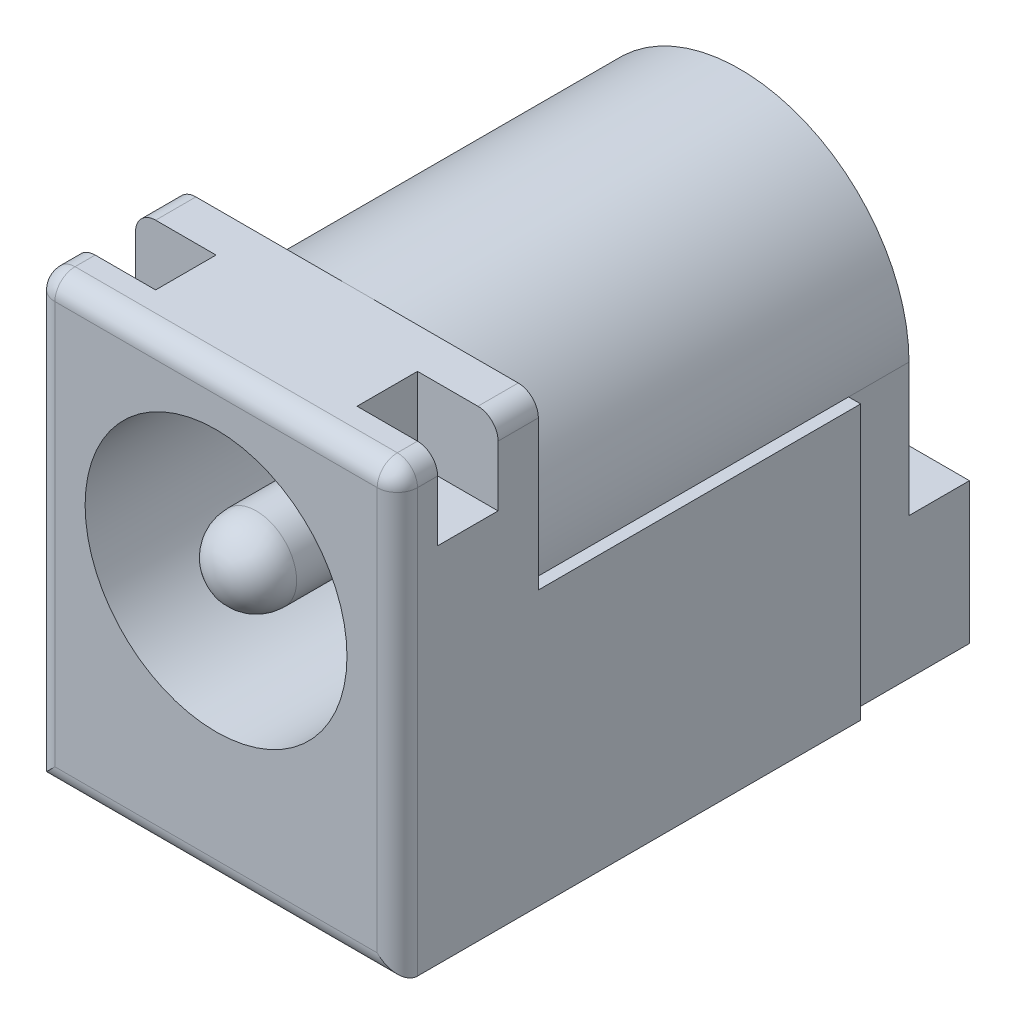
ISO-10303-21;
HEADER;
FILE_DESCRIPTION(('STEP AP214'),'2;1');
FILE_NAME('part.step','',(''),(''),'','','');
FILE_SCHEMA(('AUTOMOTIVE_DESIGN { 1 0 10303 214 1 1 1 1 }'));
ENDSEC;
DATA;
#1=APPLICATION_CONTEXT('core data for automotive mechanical design processes');
#2=APPLICATION_PROTOCOL_DEFINITION('international standard','automotive_design',2000,#1);
#3=PRODUCT_CONTEXT('',#1,'mechanical');
#4=PRODUCT('Part','Part','',(#3));
#5=PRODUCT_RELATED_PRODUCT_CATEGORY('part','',(#4));
#6=PRODUCT_DEFINITION_FORMATION('','',#4);
#7=PRODUCT_DEFINITION_CONTEXT('part definition',#1,'design');
#8=PRODUCT_DEFINITION('design','',#6,#7);
#9=PRODUCT_DEFINITION_SHAPE('','',#8);
#10=(LENGTH_UNIT() NAMED_UNIT(*) SI_UNIT(.MILLI.,.METRE.));
#11=(NAMED_UNIT(*) PLANE_ANGLE_UNIT() SI_UNIT($,.RADIAN.));
#12=(NAMED_UNIT(*) SI_UNIT($,.STERADIAN.) SOLID_ANGLE_UNIT());
#13=UNCERTAINTY_MEASURE_WITH_UNIT(LENGTH_MEASURE(1.E-05),#10,'distance_accuracy_value','');
#14=(GEOMETRIC_REPRESENTATION_CONTEXT(3) GLOBAL_UNCERTAINTY_ASSIGNED_CONTEXT((#13)) GLOBAL_UNIT_ASSIGNED_CONTEXT((#10,
#11,#12)) REPRESENTATION_CONTEXT('',''));
#15=CARTESIAN_POINT('',(0.,0.,0.));
#16=DIRECTION('',(0.,0.,1.));
#17=DIRECTION('',(1.,0.,0.));
#18=AXIS2_PLACEMENT_3D('',#15,#16,#17);
#19=CARTESIAN_POINT('',(-4.5,5.5,-14.5));
#20=DIRECTION('',(-1.,0.,0.));
#21=DIRECTION('',(0.,-1.,0.));
#22=AXIS2_PLACEMENT_3D('',#19,#20,#21);
#23=PLANE('',#22);
#24=DIRECTION('',(0.,1.,0.));
#25=VECTOR('',#24,1.);
#26=CARTESIAN_POINT('',(-4.5,5.5,-2.5));
#27=LINE('',#26,#25);
#28=CARTESIAN_POINT('',(-4.5,3.5,-2.5));
#29=VERTEX_POINT('',#28);
#30=CARTESIAN_POINT('',(-4.5,5.,-2.5));
#31=VERTEX_POINT('',#30);
#32=EDGE_CURVE('E689',#29,#31,#27,.T.);
#33=ORIENTED_EDGE('',*,*,#32,.T.);
#34=DIRECTION('',(0.,0.,1.));
#35=VECTOR('',#34,1.);
#36=CARTESIAN_POINT('',(-4.5,5.,-14.5));
#37=LINE('',#36,#35);
#38=CARTESIAN_POINT('',(-4.5,5.,-3.5));
#39=VERTEX_POINT('',#38);
#40=EDGE_CURVE('E624',#31,#39,#37,.F.);
#41=ORIENTED_EDGE('',*,*,#40,.T.);
#42=DIRECTION('',(0.,1.,0.));
#43=VECTOR('',#42,1.);
#44=CARTESIAN_POINT('',(-4.5,0.,-3.5));
#45=LINE('',#44,#43);
#46=CARTESIAN_POINT('',(-4.5,1.3,-3.5));
#47=VERTEX_POINT('',#46);
#48=EDGE_CURVE('E554',#47,#39,#45,.T.);
#49=ORIENTED_EDGE('',*,*,#48,.F.);
#50=DIRECTION('',(0.,0.,-1.));
#51=VECTOR('',#50,1.);
#52=CARTESIAN_POINT('',(-4.5,1.3,-3.5));
#53=LINE('',#52,#51);
#54=CARTESIAN_POINT('',(-4.5,1.3,-11.5));
#55=VERTEX_POINT('',#54);
#56=EDGE_CURVE('E558',#47,#55,#53,.T.);
#57=ORIENTED_EDGE('',*,*,#56,.T.);
#58=DIRECTION('',(0.,-1.,0.));
#59=VECTOR('',#58,1.);
#60=CARTESIAN_POINT('',(-4.5,1.3,-11.5));
#61=LINE('',#60,#59);
#62=CARTESIAN_POINT('',(-4.5,-5.5,-11.5));
#63=VERTEX_POINT('',#62);
#64=EDGE_CURVE('E510',#55,#63,#61,.T.);
#65=ORIENTED_EDGE('',*,*,#64,.T.);
#66=DIRECTION('',(0.,0.,1.));
#67=VECTOR('',#66,1.);
#68=CARTESIAN_POINT('',(-4.5,-5.5,-14.5));
#69=LINE('',#68,#67);
#70=CARTESIAN_POINT('',(-4.5,-5.5,-0.500000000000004));
#71=VERTEX_POINT('',#70);
#72=EDGE_CURVE('E584',#63,#71,#69,.T.);
#73=ORIENTED_EDGE('',*,*,#72,.T.);
#74=DIRECTION('',(0.,-1.,0.));
#75=VECTOR('',#74,1.);
#76=CARTESIAN_POINT('',(-4.5,5.5,-0.5));
#77=LINE('',#76,#75);
#78=CARTESIAN_POINT('',(-4.5,5.,-0.5));
#79=VERTEX_POINT('',#78);
#80=EDGE_CURVE('E620',#71,#79,#77,.F.);
#81=ORIENTED_EDGE('',*,*,#80,.T.);
#82=DIRECTION('',(0.,0.,1.));
#83=VECTOR('',#82,1.);
#84=CARTESIAN_POINT('',(-4.5,5.,-14.5));
#85=LINE('',#84,#83);
#86=CARTESIAN_POINT('',(-4.5,5.,-1.));
#87=VERTEX_POINT('',#86);
#88=EDGE_CURVE('E622',#79,#87,#85,.F.);
#89=ORIENTED_EDGE('',*,*,#88,.T.);
#90=DIRECTION('',(0.,-1.,0.));
#91=VECTOR('',#90,1.);
#92=CARTESIAN_POINT('',(-4.5,5.5,-1.));
#93=LINE('',#92,#91);
#94=CARTESIAN_POINT('',(-4.5,3.5,-1.));
#95=VERTEX_POINT('',#94);
#96=EDGE_CURVE('E687',#87,#95,#93,.T.);
#97=ORIENTED_EDGE('',*,*,#96,.T.);
#98=DIRECTION('',(0.,0.,-1.));
#99=VECTOR('',#98,1.);
#100=CARTESIAN_POINT('',(-4.5,3.5,-1.));
#101=LINE('',#100,#99);
#102=EDGE_CURVE('E684',#95,#29,#101,.T.);
#103=ORIENTED_EDGE('',*,*,#102,.T.);
#104=EDGE_LOOP('',(#33,#41,#49,#57,#65,#73,#81,#89,#97,#103));
#105=FACE_BOUND('',#104,.T.);
#106=ADVANCED_FACE('F72',(#105),#23,.T.);
#107=CARTESIAN_POINT('',(-4.5,5.5,-14.5));
#108=DIRECTION('',(0.,1.,0.));
#109=DIRECTION('',(0.,0.,1.));
#110=AXIS2_PLACEMENT_3D('',#107,#108,#109);
#111=PLANE('',#110);
#112=DIRECTION('',(1.,0.,0.));
#113=VECTOR('',#112,1.);
#114=CARTESIAN_POINT('',(0.,5.5,-3.5));
#115=LINE('',#114,#113);
#116=CARTESIAN_POINT('',(-4.,5.5,-3.5));
#117=VERTEX_POINT('',#116);
#118=CARTESIAN_POINT('',(0.,5.5,-3.5));
#119=VERTEX_POINT('',#118);
#120=EDGE_CURVE('E545',#117,#119,#115,.T.);
#121=ORIENTED_EDGE('',*,*,#120,.F.);
#122=DIRECTION('',(0.,0.,1.));
#123=VECTOR('',#122,1.);
#124=CARTESIAN_POINT('',(-4.,5.5,-14.5));
#125=LINE('',#124,#123);
#126=CARTESIAN_POINT('',(-4.,5.5,-2.5));
#127=VERTEX_POINT('',#126);
#128=EDGE_CURVE('E355',#117,#127,#125,.T.);
#129=ORIENTED_EDGE('',*,*,#128,.T.);
#130=DIRECTION('',(-1.,0.,0.));
#131=VECTOR('',#130,1.);
#132=CARTESIAN_POINT('',(-2.5,5.5,-2.5));
#133=LINE('',#132,#131);
#134=CARTESIAN_POINT('',(-2.5,5.5,-2.5));
#135=VERTEX_POINT('',#134);
#136=EDGE_CURVE('E336',#135,#127,#133,.T.);
#137=ORIENTED_EDGE('',*,*,#136,.F.);
#138=DIRECTION('',(0.,0.,1.));
#139=VECTOR('',#138,1.);
#140=CARTESIAN_POINT('',(-2.5,5.5,-1.));
#141=LINE('',#140,#139);
#142=CARTESIAN_POINT('',(-2.5,5.5,-1.));
#143=VERTEX_POINT('',#142);
#144=EDGE_CURVE('E341',#135,#143,#141,.T.);
#145=ORIENTED_EDGE('',*,*,#144,.T.);
#146=DIRECTION('',(-1.,0.,0.));
#147=VECTOR('',#146,1.);
#148=CARTESIAN_POINT('',(-2.5,5.5,-1.));
#149=LINE('',#148,#147);
#150=CARTESIAN_POINT('',(-4.,5.5,-1.));
#151=VERTEX_POINT('',#150);
#152=EDGE_CURVE('E356',#143,#151,#149,.T.);
#153=ORIENTED_EDGE('',*,*,#152,.T.);
#154=DIRECTION('',(0.,0.,1.));
#155=VECTOR('',#154,1.);
#156=CARTESIAN_POINT('',(-4.,5.5,-14.5));
#157=LINE('',#156,#155);
#158=CARTESIAN_POINT('',(-4.,5.5,-0.5));
#159=VERTEX_POINT('',#158);
#160=EDGE_CURVE('E614',#151,#159,#157,.T.);
#161=ORIENTED_EDGE('',*,*,#160,.T.);
#162=DIRECTION('',(-1.,0.,0.));
#163=VECTOR('',#162,1.);
#164=CARTESIAN_POINT('',(-4.5,5.5,-0.5));
#165=LINE('',#164,#163);
#166=CARTESIAN_POINT('',(4.,5.5,-0.5));
#167=VERTEX_POINT('',#166);
#168=EDGE_CURVE('E610',#159,#167,#165,.F.);
#169=ORIENTED_EDGE('',*,*,#168,.T.);
#170=DIRECTION('',(0.,0.,1.));
#171=VECTOR('',#170,1.);
#172=CARTESIAN_POINT('',(4.,5.5,-14.5));
#173=LINE('',#172,#171);
#174=CARTESIAN_POINT('',(4.,5.5,-1.));
#175=VERTEX_POINT('',#174);
#176=EDGE_CURVE('E612',#167,#175,#173,.F.);
#177=ORIENTED_EDGE('',*,*,#176,.T.);
#178=DIRECTION('',(1.,0.,0.));
#179=VECTOR('',#178,1.);
#180=CARTESIAN_POINT('',(2.5,5.5,-1.));
#181=LINE('',#180,#179);
#182=CARTESIAN_POINT('',(2.5,5.5,-1.));
#183=VERTEX_POINT('',#182);
#184=EDGE_CURVE('E384',#183,#175,#181,.T.);
#185=ORIENTED_EDGE('',*,*,#184,.F.);
#186=DIRECTION('',(0.,0.,1.));
#187=VECTOR('',#186,1.);
#188=CARTESIAN_POINT('',(2.5,5.5,-1.));
#189=LINE('',#188,#187);
#190=CARTESIAN_POINT('',(2.5,5.5,-2.5));
#191=VERTEX_POINT('',#190);
#192=EDGE_CURVE('E373',#191,#183,#189,.T.);
#193=ORIENTED_EDGE('',*,*,#192,.F.);
#194=DIRECTION('',(1.,0.,0.));
#195=VECTOR('',#194,1.);
#196=CARTESIAN_POINT('',(2.5,5.5,-2.5));
#197=LINE('',#196,#195);
#198=CARTESIAN_POINT('',(4.,5.5,-2.5));
#199=VERTEX_POINT('',#198);
#200=EDGE_CURVE('E388',#191,#199,#197,.T.);
#201=ORIENTED_EDGE('',*,*,#200,.T.);
#202=DIRECTION('',(0.,0.,1.));
#203=VECTOR('',#202,1.);
#204=CARTESIAN_POINT('',(4.,5.5,-14.5));
#205=LINE('',#204,#203);
#206=CARTESIAN_POINT('',(4.,5.5,-3.5));
#207=VERTEX_POINT('',#206);
#208=EDGE_CURVE('E617',#199,#207,#205,.F.);
#209=ORIENTED_EDGE('',*,*,#208,.T.);
#210=DIRECTION('',(1.,0.,0.));
#211=VECTOR('',#210,1.);
#212=CARTESIAN_POINT('',(0.,5.5,-3.5));
#213=LINE('',#212,#211);
#214=EDGE_CURVE('E569',#119,#207,#213,.T.);
#215=ORIENTED_EDGE('',*,*,#214,.F.);
#216=EDGE_LOOP('',(#121,#129,#137,#145,#153,#161,#169,#177,#185,#193,#201,#209,#215));
#217=FACE_BOUND('',#216,.T.);
#218=ADVANCED_FACE('F353',(#217),#111,.T.);
#219=CARTESIAN_POINT('',(-1.25,-11.5,-7.));
#220=DIRECTION('',(1.,0.,0.));
#221=DIRECTION('',(0.,0.,-1.));
#222=AXIS2_PLACEMENT_3D('',#219,#220,#221);
#223=PLANE('',#222);
#224=DIRECTION('',(0.,0.,1.));
#225=VECTOR('',#224,1.);
#226=CARTESIAN_POINT('',(-1.25,-8.32915619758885,-7.5));
#227=LINE('',#226,#225);
#228=CARTESIAN_POINT('',(-1.25,-8.32915619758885,-7.5));
#229=VERTEX_POINT('',#228);
#230=CARTESIAN_POINT('',(-1.25,-8.32915619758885,-7.));
#231=VERTEX_POINT('',#230);
#232=EDGE_CURVE('E410',#229,#231,#227,.T.);
#233=ORIENTED_EDGE('',*,*,#232,.T.);
#234=DIRECTION('',(0.,1.,0.));
#235=VECTOR('',#234,1.);
#236=CARTESIAN_POINT('',(-1.25,-11.5,-7.));
#237=LINE('',#236,#235);
#238=CARTESIAN_POINT('',(-1.25,-5.5,-7.));
#239=VERTEX_POINT('',#238);
#240=EDGE_CURVE('E426',#231,#239,#237,.T.);
#241=ORIENTED_EDGE('',*,*,#240,.T.);
#242=DIRECTION('',(0.,0.,-1.));
#243=VECTOR('',#242,1.);
#244=CARTESIAN_POINT('',(-1.25,-5.5,-7.));
#245=LINE('',#244,#243);
#246=CARTESIAN_POINT('',(-1.25,-5.5,-7.5));
#247=VERTEX_POINT('',#246);
#248=EDGE_CURVE('E413',#239,#247,#245,.T.);
#249=ORIENTED_EDGE('',*,*,#248,.T.);
#250=DIRECTION('',(0.,1.,0.));
#251=VECTOR('',#250,1.);
#252=CARTESIAN_POINT('',(-1.25,-11.5,-7.5));
#253=LINE('',#252,#251);
#254=EDGE_CURVE('E432',#229,#247,#253,.T.);
#255=ORIENTED_EDGE('',*,*,#254,.F.);
#256=EDGE_LOOP('',(#233,#241,#249,#255));
#257=FACE_BOUND('',#256,.T.);
#258=ADVANCED_FACE('F798',(#257),#223,.F.);
#259=CARTESIAN_POINT('',(-1.25,-11.5,-7.5));
#260=DIRECTION('',(0.,0.,1.));
#261=DIRECTION('',(1.,0.,0.));
#262=AXIS2_PLACEMENT_3D('',#259,#260,#261);
#263=PLANE('',#262);
#264=CARTESIAN_POINT('',(0.,-7.5,-7.5));
#265=DIRECTION('',(0.,0.,1.));
#266=DIRECTION('',(1.,0.,0.));
#267=AXIS2_PLACEMENT_3D('',#264,#265,#266);
#268=CIRCLE('',#267,0.6);
#269=CARTESIAN_POINT('',(0.599999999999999,-7.5,-7.5));
#270=VERTEX_POINT('',#269);
#271=EDGE_CURVE('E401',#270,#270,#268,.T.);
#272=ORIENTED_EDGE('',*,*,#271,.T.);
#273=EDGE_LOOP('',(#272));
#274=FACE_BOUND('',#273,.T.);
#275=CARTESIAN_POINT('',(0.,-7.5,-7.5));
#276=DIRECTION('',(0.,0.,1.));
#277=DIRECTION('',(1.,0.,0.));
#278=AXIS2_PLACEMENT_3D('',#275,#276,#277);
#279=CIRCLE('',#278,1.5);
#280=CARTESIAN_POINT('',(1.25,-8.32915619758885,-7.5));
#281=VERTEX_POINT('',#280);
#282=EDGE_CURVE('E405',#229,#281,#279,.T.);
#283=ORIENTED_EDGE('',*,*,#282,.F.);
#284=ORIENTED_EDGE('',*,*,#254,.T.);
#285=DIRECTION('',(1.,0.,0.));
#286=VECTOR('',#285,1.);
#287=CARTESIAN_POINT('',(-1.25,-5.5,-7.5));
#288=LINE('',#287,#286);
#289=CARTESIAN_POINT('',(1.25,-5.5,-7.5));
#290=VERTEX_POINT('',#289);
#291=EDGE_CURVE('E417',#247,#290,#288,.T.);
#292=ORIENTED_EDGE('',*,*,#291,.T.);
#293=DIRECTION('',(0.,1.,0.));
#294=VECTOR('',#293,1.);
#295=CARTESIAN_POINT('',(1.25,-11.5,-7.5));
#296=LINE('',#295,#294);
#297=EDGE_CURVE('E430',#281,#290,#296,.T.);
#298=ORIENTED_EDGE('',*,*,#297,.F.);
#299=EDGE_LOOP('',(#283,#284,#292,#298));
#300=FACE_BOUND('',#299,.T.);
#301=ADVANCED_FACE('F1021',(#274,#300),#263,.F.);
#302=CARTESIAN_POINT('',(1.25,-11.5,-7.));
#303=DIRECTION('',(-1.,0.,0.));
#304=DIRECTION('',(0.,0.,1.));
#305=AXIS2_PLACEMENT_3D('',#302,#303,#304);
#306=PLANE('',#305);
#307=DIRECTION('',(0.,0.,1.));
#308=VECTOR('',#307,1.);
#309=CARTESIAN_POINT('',(1.25,-8.32915619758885,-7.5));
#310=LINE('',#309,#308);
#311=CARTESIAN_POINT('',(1.25,-8.32915619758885,-7.));
#312=VERTEX_POINT('',#311);
#313=EDGE_CURVE('E407',#281,#312,#310,.T.);
#314=ORIENTED_EDGE('',*,*,#313,.F.);
#315=ORIENTED_EDGE('',*,*,#297,.T.);
#316=DIRECTION('',(0.,0.,1.));
#317=VECTOR('',#316,1.);
#318=CARTESIAN_POINT('',(1.25,-5.5,-7.));
#319=LINE('',#318,#317);
#320=CARTESIAN_POINT('',(1.25,-5.5,-7.));
#321=VERTEX_POINT('',#320);
#322=EDGE_CURVE('E420',#290,#321,#319,.T.);
#323=ORIENTED_EDGE('',*,*,#322,.T.);
#324=DIRECTION('',(0.,1.,0.));
#325=VECTOR('',#324,1.);
#326=CARTESIAN_POINT('',(1.25,-11.5,-7.));
#327=LINE('',#326,#325);
#328=EDGE_CURVE('E428',#312,#321,#327,.T.);
#329=ORIENTED_EDGE('',*,*,#328,.F.);
#330=EDGE_LOOP('',(#314,#315,#323,#329));
#331=FACE_BOUND('',#330,.T.);
#332=ADVANCED_FACE('F1030',(#331),#306,.F.);
#333=CARTESIAN_POINT('',(-1.25,-11.5,-7.));
#334=DIRECTION('',(0.,0.,-1.));
#335=DIRECTION('',(-1.,0.,0.));
#336=AXIS2_PLACEMENT_3D('',#333,#334,#335);
#337=PLANE('',#336);
#338=CARTESIAN_POINT('',(0.,-7.5,-7.));
#339=DIRECTION('',(0.,0.,-1.));
#340=DIRECTION('',(-1.,0.,0.));
#341=AXIS2_PLACEMENT_3D('',#338,#339,#340);
#342=CIRCLE('',#341,0.6);
#343=CARTESIAN_POINT('',(-0.600000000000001,-7.5,-7.));
#344=VERTEX_POINT('',#343);
#345=EDGE_CURVE('E398',#344,#344,#342,.T.);
#346=ORIENTED_EDGE('',*,*,#345,.T.);
#347=EDGE_LOOP('',(#346));
#348=FACE_BOUND('',#347,.T.);
#349=CARTESIAN_POINT('',(0.,-7.5,-7.));
#350=DIRECTION('',(0.,0.,1.));
#351=DIRECTION('',(1.,0.,0.));
#352=AXIS2_PLACEMENT_3D('',#349,#350,#351);
#353=CIRCLE('',#352,1.5);
#354=EDGE_CURVE('E404',#231,#312,#353,.T.);
#355=ORIENTED_EDGE('',*,*,#354,.T.);
#356=ORIENTED_EDGE('',*,*,#328,.T.);
#357=DIRECTION('',(-1.,0.,0.));
#358=VECTOR('',#357,1.);
#359=CARTESIAN_POINT('',(-1.25,-5.5,-7.));
#360=LINE('',#359,#358);
#361=EDGE_CURVE('E423',#321,#239,#360,.T.);
#362=ORIENTED_EDGE('',*,*,#361,.T.);
#363=ORIENTED_EDGE('',*,*,#240,.F.);
#364=EDGE_LOOP('',(#355,#356,#362,#363));
#365=FACE_BOUND('',#364,.T.);
#366=ADVANCED_FACE('F1039',(#348,#365),#337,.F.);
#367=CARTESIAN_POINT('',(-4.5,-5.5,-14.5));
#368=DIRECTION('',(0.,-1.,0.));
#369=DIRECTION('',(0.,0.,-1.));
#370=AXIS2_PLACEMENT_3D('',#367,#368,#369);
#371=PLANE('',#370);
#372=DIRECTION('',(0.,0.,1.));
#373=VECTOR('',#372,1.);
#374=CARTESIAN_POINT('',(4.5,-5.5,-14.5));
#375=LINE('',#374,#373);
#376=CARTESIAN_POINT('',(4.5,-5.5,-11.5));
#377=VERTEX_POINT('',#376);
#378=CARTESIAN_POINT('',(4.5,-5.5,-0.500000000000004));
#379=VERTEX_POINT('',#378);
#380=EDGE_CURVE('E585',#377,#379,#375,.T.);
#381=ORIENTED_EDGE('',*,*,#380,.T.);
#382=DIRECTION('',(1.,0.,0.));
#383=VECTOR('',#382,1.);
#384=CARTESIAN_POINT('',(-4.5,-5.5,-0.5));
#385=LINE('',#384,#383);
#386=EDGE_CURVE('E14',#379,#71,#385,.F.);
#387=ORIENTED_EDGE('',*,*,#386,.T.);
#388=ORIENTED_EDGE('',*,*,#72,.F.);
#389=DIRECTION('',(-1.,0.,0.));
#390=VECTOR('',#389,1.);
#391=CARTESIAN_POINT('',(-4.2,-5.5,-11.5));
#392=LINE('',#391,#390);
#393=CARTESIAN_POINT('',(-4.2,-5.5,-11.5));
#394=VERTEX_POINT('',#393);
#395=EDGE_CURVE('E521',#394,#63,#392,.T.);
#396=ORIENTED_EDGE('',*,*,#395,.F.);
#397=DIRECTION('',(0.,0.,-1.));
#398=VECTOR('',#397,1.);
#399=CARTESIAN_POINT('',(-4.2,-5.5,-11.5));
#400=LINE('',#399,#398);
#401=CARTESIAN_POINT('',(-4.2,-5.5,-14.5));
#402=VERTEX_POINT('',#401);
#403=EDGE_CURVE('E511',#394,#402,#400,.T.);
#404=ORIENTED_EDGE('',*,*,#403,.T.);
#405=DIRECTION('',(1.,0.,0.));
#406=VECTOR('',#405,1.);
#407=CARTESIAN_POINT('',(-4.5,-5.5,-14.5));
#408=LINE('',#407,#406);
#409=CARTESIAN_POINT('',(-1.75,-5.5,-14.5));
#410=VERTEX_POINT('',#409);
#411=EDGE_CURVE('E581',#402,#410,#408,.T.);
#412=ORIENTED_EDGE('',*,*,#411,.T.);
#413=DIRECTION('',(0.,0.,-1.));
#414=VECTOR('',#413,1.);
#415=CARTESIAN_POINT('',(-1.75,-5.5,-8.05025253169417));
#416=LINE('',#415,#414);
#417=CARTESIAN_POINT('',(-1.75,-5.5,-13.));
#418=VERTEX_POINT('',#417);
#419=EDGE_CURVE('E478',#418,#410,#416,.T.);
#420=ORIENTED_EDGE('',*,*,#419,.F.);
#421=DIRECTION('',(-1.,0.,0.));
#422=VECTOR('',#421,1.);
#423=CARTESIAN_POINT('',(1.75,-5.5,-13.));
#424=LINE('',#423,#422);
#425=CARTESIAN_POINT('',(-1.5,-5.5,-13.));
#426=VERTEX_POINT('',#425);
#427=EDGE_CURVE('E473',#426,#418,#424,.T.);
#428=ORIENTED_EDGE('',*,*,#427,.F.);
#429=CARTESIAN_POINT('',(1.5,-5.5,-13.));
#430=VERTEX_POINT('',#429);
#431=EDGE_CURVE('E479',#430,#426,#424,.T.);
#432=ORIENTED_EDGE('',*,*,#431,.F.);
#433=CARTESIAN_POINT('',(1.75,-5.5,-13.));
#434=VERTEX_POINT('',#433);
#435=EDGE_CURVE('E475',#434,#430,#424,.T.);
#436=ORIENTED_EDGE('',*,*,#435,.F.);
#437=DIRECTION('',(0.,0.,-1.));
#438=VECTOR('',#437,1.);
#439=CARTESIAN_POINT('',(1.75,-5.5,-8.05025253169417));
#440=LINE('',#439,#438);
#441=CARTESIAN_POINT('',(1.75,-5.5,-14.5));
#442=VERTEX_POINT('',#441);
#443=EDGE_CURVE('E482',#434,#442,#440,.T.);
#444=ORIENTED_EDGE('',*,*,#443,.T.);
#445=CARTESIAN_POINT('',(4.2,-5.5,-14.5));
#446=VERTEX_POINT('',#445);
#447=EDGE_CURVE('E578',#442,#446,#408,.T.);
#448=ORIENTED_EDGE('',*,*,#447,.T.);
#449=DIRECTION('',(0.,0.,-1.));
#450=VECTOR('',#449,1.);
#451=CARTESIAN_POINT('',(4.2,-5.5,-11.5));
#452=LINE('',#451,#450);
#453=CARTESIAN_POINT('',(4.2,-5.5,-11.5));
#454=VERTEX_POINT('',#453);
#455=EDGE_CURVE('E529',#454,#446,#452,.T.);
#456=ORIENTED_EDGE('',*,*,#455,.F.);
#457=DIRECTION('',(1.,0.,0.));
#458=VECTOR('',#457,1.);
#459=CARTESIAN_POINT('',(4.2,-5.5,-11.5));
#460=LINE('',#459,#458);
#461=EDGE_CURVE('E542',#454,#377,#460,.T.);
#462=ORIENTED_EDGE('',*,*,#461,.T.);
#463=EDGE_LOOP('',(#381,#387,#388,#396,#404,#412,#420,#428,#432,#436,#444,#448,#456,#462));
#464=FACE_BOUND('',#463,.T.);
#465=ORIENTED_EDGE('',*,*,#291,.F.);
#466=ORIENTED_EDGE('',*,*,#248,.F.);
#467=ORIENTED_EDGE('',*,*,#361,.F.);
#468=ORIENTED_EDGE('',*,*,#322,.F.);
#469=EDGE_LOOP('',(#465,#466,#467,#468));
#470=FACE_BOUND('',#469,.T.);
#471=ADVANCED_FACE('F776',(#464,#470),#371,.T.);
#472=CARTESIAN_POINT('',(-4.5,-2.,-13.));
#473=DIRECTION('',(0.,0.,1.));
#474=DIRECTION('',(1.,0.,0.));
#475=AXIS2_PLACEMENT_3D('',#472,#473,#474);
#476=PLANE('',#475);
#477=DIRECTION('',(0.,-1.,0.));
#478=VECTOR('',#477,1.);
#479=CARTESIAN_POINT('',(1.5,1.3,-13.));
#480=LINE('',#479,#478);
#481=CARTESIAN_POINT('',(1.5,1.3,-13.));
#482=VERTEX_POINT('',#481);
#483=EDGE_CURVE('E452',#482,#430,#480,.T.);
#484=ORIENTED_EDGE('',*,*,#483,.F.);
#485=CARTESIAN_POINT('',(0.,1.3,-13.));
#486=DIRECTION('',(0.,0.,-1.));
#487=DIRECTION('',(-1.,0.,0.));
#488=AXIS2_PLACEMENT_3D('',#485,#486,#487);
#489=CIRCLE('',#488,1.5);
#490=CARTESIAN_POINT('',(-1.5,1.3,-13.));
#491=VERTEX_POINT('',#490);
#492=EDGE_CURVE('E437',#491,#482,#489,.T.);
#493=ORIENTED_EDGE('',*,*,#492,.F.);
#494=DIRECTION('',(0.,1.,0.));
#495=VECTOR('',#494,1.);
#496=CARTESIAN_POINT('',(-1.5,-2.,-13.));
#497=LINE('',#496,#495);
#498=EDGE_CURVE('E596',#426,#491,#497,.T.);
#499=ORIENTED_EDGE('',*,*,#498,.F.);
#500=ORIENTED_EDGE('',*,*,#427,.T.);
#501=DIRECTION('',(0.,1.,0.));
#502=VECTOR('',#501,1.);
#503=CARTESIAN_POINT('',(-1.75,-5.5,-13.));
#504=LINE('',#503,#502);
#505=CARTESIAN_POINT('',(-1.75,-2.,-13.));
#506=VERTEX_POINT('',#505);
#507=EDGE_CURVE('E484',#418,#506,#504,.T.);
#508=ORIENTED_EDGE('',*,*,#507,.T.);
#509=DIRECTION('',(1.,0.,0.));
#510=VECTOR('',#509,1.);
#511=CARTESIAN_POINT('',(-4.5,-2.,-13.));
#512=LINE('',#511,#510);
#513=CARTESIAN_POINT('',(-4.2,-2.,-13.));
#514=VERTEX_POINT('',#513);
#515=EDGE_CURVE('E506',#514,#506,#512,.T.);
#516=ORIENTED_EDGE('',*,*,#515,.F.);
#517=DIRECTION('',(0.,1.,0.));
#518=VECTOR('',#517,1.);
#519=CARTESIAN_POINT('',(-4.2,0.,-13.));
#520=LINE('',#519,#518);
#521=CARTESIAN_POINT('',(-4.2,1.3,-13.));
#522=VERTEX_POINT('',#521);
#523=EDGE_CURVE('E588',#514,#522,#520,.T.);
#524=ORIENTED_EDGE('',*,*,#523,.T.);
#525=CARTESIAN_POINT('',(0.,1.3,-13.));
#526=DIRECTION('',(0.,0.,1.));
#527=DIRECTION('',(1.,0.,0.));
#528=AXIS2_PLACEMENT_3D('',#525,#526,#527);
#529=CIRCLE('',#528,4.2);
#530=CARTESIAN_POINT('',(4.2,1.3,-13.));
#531=VERTEX_POINT('',#530);
#532=EDGE_CURVE('E504',#531,#522,#529,.T.);
#533=ORIENTED_EDGE('',*,*,#532,.F.);
#534=DIRECTION('',(0.,-1.,0.));
#535=VECTOR('',#534,1.);
#536=CARTESIAN_POINT('',(4.2,-2.,-13.));
#537=LINE('',#536,#535);
#538=CARTESIAN_POINT('',(4.2,-2.,-13.));
#539=VERTEX_POINT('',#538);
#540=EDGE_CURVE('E494',#531,#539,#537,.T.);
#541=ORIENTED_EDGE('',*,*,#540,.T.);
#542=CARTESIAN_POINT('',(1.75,-2.,-13.));
#543=VERTEX_POINT('',#542);
#544=EDGE_CURVE('E500',#543,#539,#512,.T.);
#545=ORIENTED_EDGE('',*,*,#544,.F.);
#546=DIRECTION('',(0.,-1.,0.));
#547=VECTOR('',#546,1.);
#548=CARTESIAN_POINT('',(1.75,-5.5,-13.));
#549=LINE('',#548,#547);
#550=EDGE_CURVE('E480',#543,#434,#549,.T.);
#551=ORIENTED_EDGE('',*,*,#550,.T.);
#552=ORIENTED_EDGE('',*,*,#435,.T.);
#553=EDGE_LOOP('',(#484,#493,#499,#500,#508,#516,#524,#533,#541,#545,#551,#552));
#554=FACE_BOUND('',#553,.T.);
#555=ADVANCED_FACE('F1055',(#554),#476,.F.);
#556=CARTESIAN_POINT('',(0.,0.,-14.5));
#557=DIRECTION('',(0.,0.,1.));
#558=DIRECTION('',(1.,0.,0.));
#559=AXIS2_PLACEMENT_3D('',#556,#557,#558);
#560=PLANE('',#559);
#561=DIRECTION('',(1.,0.,0.));
#562=VECTOR('',#561,1.);
#563=CARTESIAN_POINT('',(-4.5,-2.,-14.5));
#564=LINE('',#563,#562);
#565=CARTESIAN_POINT('',(-4.2,-2.,-14.5));
#566=VERTEX_POINT('',#565);
#567=CARTESIAN_POINT('',(-1.75,-2.,-14.5));
#568=VERTEX_POINT('',#567);
#569=EDGE_CURVE('E501',#566,#568,#564,.T.);
#570=ORIENTED_EDGE('',*,*,#569,.T.);
#571=DIRECTION('',(0.,1.,0.));
#572=VECTOR('',#571,1.);
#573=CARTESIAN_POINT('',(-1.75,-5.5,-14.5));
#574=LINE('',#573,#572);
#575=EDGE_CURVE('E471',#410,#568,#574,.T.);
#576=ORIENTED_EDGE('',*,*,#575,.F.);
#577=ORIENTED_EDGE('',*,*,#411,.F.);
#578=DIRECTION('',(0.,1.,0.));
#579=VECTOR('',#578,1.);
#580=CARTESIAN_POINT('',(-4.2,-5.5,-14.5));
#581=LINE('',#580,#579);
#582=EDGE_CURVE('E518',#402,#566,#581,.T.);
#583=ORIENTED_EDGE('',*,*,#582,.T.);
#584=EDGE_LOOP('',(#570,#576,#577,#583));
#585=FACE_BOUND('',#584,.T.);
#586=ADVANCED_FACE('F1136',(#585),#560,.F.);
#587=CARTESIAN_POINT('',(-4.5,-2.,-14.5));
#588=DIRECTION('',(0.,-1.,0.));
#589=DIRECTION('',(1.,0.,0.));
#590=AXIS2_PLACEMENT_3D('',#587,#588,#589);
#591=PLANE('',#590);
#592=ORIENTED_EDGE('',*,*,#515,.T.);
#593=DIRECTION('',(0.,0.,-1.));
#594=VECTOR('',#593,1.);
#595=CARTESIAN_POINT('',(-1.75,-2.,-8.05025253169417));
#596=LINE('',#595,#594);
#597=EDGE_CURVE('E487',#506,#568,#596,.T.);
#598=ORIENTED_EDGE('',*,*,#597,.T.);
#599=ORIENTED_EDGE('',*,*,#569,.F.);
#600=DIRECTION('',(0.,0.,1.));
#601=VECTOR('',#600,1.);
#602=CARTESIAN_POINT('',(-4.2,-2.,0.));
#603=LINE('',#602,#601);
#604=EDGE_CURVE('E593',#566,#514,#603,.T.);
#605=ORIENTED_EDGE('',*,*,#604,.T.);
#606=EDGE_LOOP('',(#592,#598,#599,#605));
#607=FACE_BOUND('',#606,.T.);
#608=ADVANCED_FACE('F1173',(#607),#591,.F.);
#609=ORIENTED_EDGE('',*,*,#447,.F.);
#610=DIRECTION('',(0.,-1.,0.));
#611=VECTOR('',#610,1.);
#612=CARTESIAN_POINT('',(1.75,-5.5,-14.5));
#613=LINE('',#612,#611);
#614=CARTESIAN_POINT('',(1.75,-2.,-14.5));
#615=VERTEX_POINT('',#614);
#616=EDGE_CURVE('E470',#615,#442,#613,.T.);
#617=ORIENTED_EDGE('',*,*,#616,.F.);
#618=CARTESIAN_POINT('',(4.2,-2.,-14.5));
#619=VERTEX_POINT('',#618);
#620=EDGE_CURVE('E505',#615,#619,#564,.T.);
#621=ORIENTED_EDGE('',*,*,#620,.T.);
#622=DIRECTION('',(0.,1.,0.));
#623=VECTOR('',#622,1.);
#624=CARTESIAN_POINT('',(4.2,-5.5,-14.5));
#625=LINE('',#624,#623);
#626=EDGE_CURVE('E532',#446,#619,#625,.T.);
#627=ORIENTED_EDGE('',*,*,#626,.F.);
#628=EDGE_LOOP('',(#609,#617,#621,#627));
#629=FACE_BOUND('',#628,.T.);
#630=ADVANCED_FACE('F1180',(#629),#560,.F.);
#631=CARTESIAN_POINT('',(0.,1.3,-3.5));
#632=DIRECTION('',(0.,-1.,0.));
#633=DIRECTION('',(0.,0.,-1.));
#634=AXIS2_PLACEMENT_3D('',#631,#632,#633);
#635=PLANE('',#634);
#636=DIRECTION('',(-1.,0.,0.));
#637=VECTOR('',#636,1.);
#638=CARTESIAN_POINT('',(-4.2,1.3,-11.5));
#639=LINE('',#638,#637);
#640=CARTESIAN_POINT('',(-4.2,1.3,-11.5));
#641=VERTEX_POINT('',#640);
#642=EDGE_CURVE('E524',#641,#55,#639,.T.);
#643=ORIENTED_EDGE('',*,*,#642,.T.);
#644=ORIENTED_EDGE('',*,*,#56,.F.);
#645=DIRECTION('',(-1.,0.,0.));
#646=VECTOR('',#645,1.);
#647=CARTESIAN_POINT('',(0.,1.3,-3.5));
#648=LINE('',#647,#646);
#649=CARTESIAN_POINT('',(-4.2,1.3,-3.5));
#650=VERTEX_POINT('',#649);
#651=EDGE_CURVE('E551',#650,#47,#648,.T.);
#652=ORIENTED_EDGE('',*,*,#651,.F.);
#653=DIRECTION('',(0.,0.,-1.));
#654=VECTOR('',#653,1.);
#655=CARTESIAN_POINT('',(-4.2,1.3,-3.5));
#656=LINE('',#655,#654);
#657=EDGE_CURVE('E557',#650,#641,#656,.T.);
#658=ORIENTED_EDGE('',*,*,#657,.T.);
#659=EDGE_LOOP('',(#643,#644,#652,#658));
#660=FACE_BOUND('',#659,.T.);
#661=ADVANCED_FACE('F768',(#660),#635,.F.);
#662=CARTESIAN_POINT('',(4.5,5.5,-14.5));
#663=DIRECTION('',(1.,0.,0.));
#664=DIRECTION('',(0.,1.,0.));
#665=AXIS2_PLACEMENT_3D('',#662,#663,#664);
#666=PLANE('',#665);
#667=DIRECTION('',(0.,-1.,0.));
#668=VECTOR('',#667,1.);
#669=CARTESIAN_POINT('',(4.5,0.,-3.5));
#670=LINE('',#669,#668);
#671=CARTESIAN_POINT('',(4.5,5.,-3.5));
#672=VERTEX_POINT('',#671);
#673=CARTESIAN_POINT('',(4.5,1.3,-3.5));
#674=VERTEX_POINT('',#673);
#675=EDGE_CURVE('E572',#672,#674,#670,.T.);
#676=ORIENTED_EDGE('',*,*,#675,.F.);
#677=DIRECTION('',(0.,0.,1.));
#678=VECTOR('',#677,1.);
#679=CARTESIAN_POINT('',(4.5,5.,-14.5));
#680=LINE('',#679,#678);
#681=CARTESIAN_POINT('',(4.5,5.,-2.5));
#682=VERTEX_POINT('',#681);
#683=EDGE_CURVE('E636',#672,#682,#680,.T.);
#684=ORIENTED_EDGE('',*,*,#683,.T.);
#685=DIRECTION('',(0.,1.,0.));
#686=VECTOR('',#685,1.);
#687=CARTESIAN_POINT('',(4.5,5.5,-2.5));
#688=LINE('',#687,#686);
#689=CARTESIAN_POINT('',(4.5,3.5,-2.5));
#690=VERTEX_POINT('',#689);
#691=EDGE_CURVE('E367',#690,#682,#688,.T.);
#692=ORIENTED_EDGE('',*,*,#691,.F.);
#693=DIRECTION('',(0.,0.,-1.));
#694=VECTOR('',#693,1.);
#695=CARTESIAN_POINT('',(4.5,3.5,-1.));
#696=LINE('',#695,#694);
#697=CARTESIAN_POINT('',(4.5,3.5,-1.));
#698=VERTEX_POINT('',#697);
#699=EDGE_CURVE('E379',#698,#690,#696,.T.);
#700=ORIENTED_EDGE('',*,*,#699,.F.);
#701=DIRECTION('',(0.,-1.,0.));
#702=VECTOR('',#701,1.);
#703=CARTESIAN_POINT('',(4.5,5.5,-1.));
#704=LINE('',#703,#702);
#705=CARTESIAN_POINT('',(4.5,5.,-1.));
#706=VERTEX_POINT('',#705);
#707=EDGE_CURVE('E377',#706,#698,#704,.T.);
#708=ORIENTED_EDGE('',*,*,#707,.F.);
#709=DIRECTION('',(0.,0.,1.));
#710=VECTOR('',#709,1.);
#711=CARTESIAN_POINT('',(4.5,5.,-14.5));
#712=LINE('',#711,#710);
#713=CARTESIAN_POINT('',(4.5,5.,-0.5));
#714=VERTEX_POINT('',#713);
#715=EDGE_CURVE('E634',#706,#714,#712,.T.);
#716=ORIENTED_EDGE('',*,*,#715,.T.);
#717=DIRECTION('',(0.,1.,0.));
#718=VECTOR('',#717,1.);
#719=CARTESIAN_POINT('',(4.5,5.5,-0.5));
#720=LINE('',#719,#718);
#721=EDGE_CURVE('E632',#714,#379,#720,.F.);
#722=ORIENTED_EDGE('',*,*,#721,.T.);
#723=ORIENTED_EDGE('',*,*,#380,.F.);
#724=DIRECTION('',(0.,-1.,0.));
#725=VECTOR('',#724,1.);
#726=CARTESIAN_POINT('',(4.5,1.3,-11.5));
#727=LINE('',#726,#725);
#728=CARTESIAN_POINT('',(4.5,1.3,-11.5));
#729=VERTEX_POINT('',#728);
#730=EDGE_CURVE('E527',#729,#377,#727,.T.);
#731=ORIENTED_EDGE('',*,*,#730,.F.);
#732=DIRECTION('',(0.,0.,-1.));
#733=VECTOR('',#732,1.);
#734=CARTESIAN_POINT('',(4.5,1.3,-3.5));
#735=LINE('',#734,#733);
#736=EDGE_CURVE('E575',#674,#729,#735,.T.);
#737=ORIENTED_EDGE('',*,*,#736,.F.);
#738=EDGE_LOOP('',(#676,#684,#692,#700,#708,#716,#722,#723,#731,#737));
#739=FACE_BOUND('',#738,.T.);
#740=ADVANCED_FACE('F729',(#739),#666,.T.);
#741=CARTESIAN_POINT('',(0.,0.,0.));
#742=DIRECTION('',(0.,0.,1.));
#743=DIRECTION('',(1.,0.,0.));
#744=AXIS2_PLACEMENT_3D('',#741,#742,#743);
#745=PLANE('',#744);
#746=DIRECTION('',(-1.,0.,0.));
#747=VECTOR('',#746,1.);
#748=CARTESIAN_POINT('',(0.,5.,0.));
#749=LINE('',#748,#747);
#750=CARTESIAN_POINT('',(4.,5.,0.));
#751=VERTEX_POINT('',#750);
#752=CARTESIAN_POINT('',(-4.,5.,0.));
#753=VERTEX_POINT('',#752);
#754=EDGE_CURVE('E93',#751,#753,#749,.T.);
#755=ORIENTED_EDGE('',*,*,#754,.T.);
#756=DIRECTION('',(0.,-1.,0.));
#757=VECTOR('',#756,1.);
#758=CARTESIAN_POINT('',(-4.,0.,0.));
#759=LINE('',#758,#757);
#760=CARTESIAN_POINT('',(-4.,-5.,0.));
#761=VERTEX_POINT('',#760);
#762=EDGE_CURVE('E81',#753,#761,#759,.T.);
#763=ORIENTED_EDGE('',*,*,#762,.T.);
#764=DIRECTION('',(1.,0.,0.));
#765=VECTOR('',#764,1.);
#766=CARTESIAN_POINT('',(0.,-5.,0.));
#767=LINE('',#766,#765);
#768=CARTESIAN_POINT('',(4.,-5.,0.));
#769=VERTEX_POINT('',#768);
#770=EDGE_CURVE('E648',#761,#769,#767,.T.);
#771=ORIENTED_EDGE('',*,*,#770,.T.);
#772=DIRECTION('',(0.,1.,0.));
#773=VECTOR('',#772,1.);
#774=CARTESIAN_POINT('',(4.,0.,0.));
#775=LINE('',#774,#773);
#776=EDGE_CURVE('E645',#769,#751,#775,.T.);
#777=ORIENTED_EDGE('',*,*,#776,.T.);
#778=EDGE_LOOP('',(#755,#763,#771,#777));
#779=FACE_BOUND('',#778,.T.);
#780=CARTESIAN_POINT('',(0.,0.999999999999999,0.));
#781=DIRECTION('',(0.,0.,1.));
#782=DIRECTION('',(1.,0.,0.));
#783=AXIS2_PLACEMENT_3D('',#780,#781,#782);
#784=CIRCLE('',#783,3.25);
#785=CARTESIAN_POINT('',(3.25,0.999999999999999,0.));
#786=VERTEX_POINT('',#785);
#787=EDGE_CURVE('E672',#786,#786,#784,.T.);
#788=ORIENTED_EDGE('',*,*,#787,.F.);
#789=EDGE_LOOP('',(#788));
#790=FACE_BOUND('',#789,.T.);
#791=ADVANCED_FACE('F805',(#779,#790),#745,.T.);
#792=CARTESIAN_POINT('',(0.,1.3,-3.5));
#793=DIRECTION('',(0.,1.,0.));
#794=DIRECTION('',(0.,0.,1.));
#795=AXIS2_PLACEMENT_3D('',#792,#793,#794);
#796=PLANE('',#795);
#797=DIRECTION('',(1.,0.,0.));
#798=VECTOR('',#797,1.);
#799=CARTESIAN_POINT('',(4.2,1.3,-11.5));
#800=LINE('',#799,#798);
#801=CARTESIAN_POINT('',(4.2,1.3,-11.5));
#802=VERTEX_POINT('',#801);
#803=EDGE_CURVE('E540',#802,#729,#800,.T.);
#804=ORIENTED_EDGE('',*,*,#803,.F.);
#805=DIRECTION('',(0.,0.,-1.));
#806=VECTOR('',#805,1.);
#807=CARTESIAN_POINT('',(4.2,1.3,-3.5));
#808=LINE('',#807,#806);
#809=CARTESIAN_POINT('',(4.2,1.3,-3.5));
#810=VERTEX_POINT('',#809);
#811=EDGE_CURVE('E574',#810,#802,#808,.T.);
#812=ORIENTED_EDGE('',*,*,#811,.F.);
#813=DIRECTION('',(1.,0.,0.));
#814=VECTOR('',#813,1.);
#815=CARTESIAN_POINT('',(0.,1.3,-3.5));
#816=LINE('',#815,#814);
#817=EDGE_CURVE('E561',#810,#674,#816,.T.);
#818=ORIENTED_EDGE('',*,*,#817,.T.);
#819=ORIENTED_EDGE('',*,*,#736,.T.);
#820=EDGE_LOOP('',(#804,#812,#818,#819));
#821=FACE_BOUND('',#820,.T.);
#822=ADVANCED_FACE('F753',(#821),#796,.T.);
#823=CARTESIAN_POINT('',(0.,1.3,-3.5));
#824=DIRECTION('',(0.,0.,-1.));
#825=DIRECTION('',(-1.,0.,0.));
#826=AXIS2_PLACEMENT_3D('',#823,#824,#825);
#827=CYLINDRICAL_SURFACE('',#826,4.2);
#828=DIRECTION('',(0.,0.,1.));
#829=VECTOR('',#828,1.);
#830=CARTESIAN_POINT('',(4.2,1.3,-14.5));
#831=LINE('',#830,#829);
#832=EDGE_CURVE('E535',#531,#802,#831,.T.);
#833=ORIENTED_EDGE('',*,*,#832,.F.);
#834=ORIENTED_EDGE('',*,*,#532,.T.);
#835=DIRECTION('',(0.,0.,1.));
#836=VECTOR('',#835,1.);
#837=CARTESIAN_POINT('',(-4.2,1.3,-14.5));
#838=LINE('',#837,#836);
#839=EDGE_CURVE('E516',#522,#641,#838,.T.);
#840=ORIENTED_EDGE('',*,*,#839,.T.);
#841=ORIENTED_EDGE('',*,*,#657,.F.);
#842=CARTESIAN_POINT('',(0.,1.3,-3.5));
#843=DIRECTION('',(0.,0.,-1.));
#844=DIRECTION('',(-1.,0.,0.));
#845=AXIS2_PLACEMENT_3D('',#842,#843,#844);
#846=CIRCLE('',#845,4.2);
#847=EDGE_CURVE('E548',#119,#650,#846,.F.);
#848=ORIENTED_EDGE('',*,*,#847,.F.);
#849=CARTESIAN_POINT('',(0.,1.3,-3.5));
#850=DIRECTION('',(0.,0.,-1.));
#851=DIRECTION('',(-1.,0.,0.));
#852=AXIS2_PLACEMENT_3D('',#849,#850,#851);
#853=CIRCLE('',#852,4.2);
#854=EDGE_CURVE('E566',#810,#119,#853,.F.);
#855=ORIENTED_EDGE('',*,*,#854,.F.);
#856=ORIENTED_EDGE('',*,*,#811,.T.);
#857=EDGE_LOOP('',(#833,#834,#840,#841,#848,#855,#856));
#858=FACE_BOUND('',#857,.T.);
#859=ADVANCED_FACE('F758',(#858),#827,.T.);
#860=CARTESIAN_POINT('',(0.,0.,-3.5));
#861=DIRECTION('',(0.,0.,-1.));
#862=DIRECTION('',(-1.,0.,0.));
#863=AXIS2_PLACEMENT_3D('',#860,#861,#862);
#864=PLANE('',#863);
#865=ORIENTED_EDGE('',*,*,#214,.T.);
#866=CARTESIAN_POINT('',(4.,5.,-3.5));
#867=DIRECTION('',(0.,0.,-1.));
#868=DIRECTION('',(-1.,0.,0.));
#869=AXIS2_PLACEMENT_3D('',#866,#867,#868);
#870=CIRCLE('',#869,0.5);
#871=EDGE_CURVE('E643',#207,#672,#870,.T.);
#872=ORIENTED_EDGE('',*,*,#871,.T.);
#873=ORIENTED_EDGE('',*,*,#675,.T.);
#874=ORIENTED_EDGE('',*,*,#817,.F.);
#875=ORIENTED_EDGE('',*,*,#854,.T.);
#876=EDGE_LOOP('',(#865,#872,#873,#874,#875));
#877=FACE_BOUND('',#876,.T.);
#878=ADVANCED_FACE('F746',(#877),#864,.T.);
#879=CARTESIAN_POINT('',(0.,0.,-3.5));
#880=DIRECTION('',(0.,0.,-1.));
#881=DIRECTION('',(-1.,0.,0.));
#882=AXIS2_PLACEMENT_3D('',#879,#880,#881);
#883=PLANE('',#882);
#884=ORIENTED_EDGE('',*,*,#48,.T.);
#885=CARTESIAN_POINT('',(-4.,5.,-3.5));
#886=DIRECTION('',(0.,0.,-1.));
#887=DIRECTION('',(-1.,0.,0.));
#888=AXIS2_PLACEMENT_3D('',#885,#886,#887);
#889=CIRCLE('',#888,0.5);
#890=EDGE_CURVE('E630',#39,#117,#889,.T.);
#891=ORIENTED_EDGE('',*,*,#890,.T.);
#892=ORIENTED_EDGE('',*,*,#120,.T.);
#893=ORIENTED_EDGE('',*,*,#847,.T.);
#894=ORIENTED_EDGE('',*,*,#651,.T.);
#895=EDGE_LOOP('',(#884,#891,#892,#893,#894));
#896=FACE_BOUND('',#895,.T.);
#897=ADVANCED_FACE('F761',(#896),#883,.T.);
#898=CARTESIAN_POINT('',(4.2,1.3,-11.5));
#899=DIRECTION('',(0.,0.,1.));
#900=DIRECTION('',(1.,0.,0.));
#901=AXIS2_PLACEMENT_3D('',#898,#899,#900);
#902=PLANE('',#901);
#903=ORIENTED_EDGE('',*,*,#730,.T.);
#904=ORIENTED_EDGE('',*,*,#461,.F.);
#905=DIRECTION('',(0.,-1.,0.));
#906=VECTOR('',#905,1.);
#907=CARTESIAN_POINT('',(4.2,1.3,-11.5));
#908=LINE('',#907,#906);
#909=EDGE_CURVE('E537',#802,#454,#908,.T.);
#910=ORIENTED_EDGE('',*,*,#909,.F.);
#911=ORIENTED_EDGE('',*,*,#803,.T.);
#912=EDGE_LOOP('',(#903,#904,#910,#911));
#913=FACE_BOUND('',#912,.T.);
#914=ADVANCED_FACE('F1219',(#913),#902,.F.);
#915=CARTESIAN_POINT('',(4.2,0.,0.));
#916=DIRECTION('',(1.,0.,0.));
#917=DIRECTION('',(0.,1.,0.));
#918=AXIS2_PLACEMENT_3D('',#915,#916,#917);
#919=PLANE('',#918);
#920=DIRECTION('',(0.,0.,-1.));
#921=VECTOR('',#920,1.);
#922=CARTESIAN_POINT('',(4.2,-2.,-14.5));
#923=LINE('',#922,#921);
#924=EDGE_CURVE('E497',#539,#619,#923,.T.);
#925=ORIENTED_EDGE('',*,*,#924,.F.);
#926=ORIENTED_EDGE('',*,*,#540,.F.);
#927=ORIENTED_EDGE('',*,*,#832,.T.);
#928=ORIENTED_EDGE('',*,*,#909,.T.);
#929=ORIENTED_EDGE('',*,*,#455,.T.);
#930=ORIENTED_EDGE('',*,*,#626,.T.);
#931=EDGE_LOOP('',(#925,#926,#927,#928,#929,#930));
#932=FACE_BOUND('',#931,.T.);
#933=ADVANCED_FACE('F1214',(#932),#919,.T.);
#934=CARTESIAN_POINT('',(-4.2,1.3,-11.5));
#935=DIRECTION('',(0.,0.,-1.));
#936=DIRECTION('',(-1.,0.,0.));
#937=AXIS2_PLACEMENT_3D('',#934,#935,#936);
#938=PLANE('',#937);
#939=ORIENTED_EDGE('',*,*,#64,.F.);
#940=ORIENTED_EDGE('',*,*,#642,.F.);
#941=DIRECTION('',(0.,-1.,0.));
#942=VECTOR('',#941,1.);
#943=CARTESIAN_POINT('',(-4.2,1.3,-11.5));
#944=LINE('',#943,#942);
#945=EDGE_CURVE('E514',#641,#394,#944,.T.);
#946=ORIENTED_EDGE('',*,*,#945,.T.);
#947=ORIENTED_EDGE('',*,*,#395,.T.);
#948=EDGE_LOOP('',(#939,#940,#946,#947));
#949=FACE_BOUND('',#948,.T.);
#950=ADVANCED_FACE('F771',(#949),#938,.T.);
#951=CARTESIAN_POINT('',(-4.2,0.,0.));
#952=DIRECTION('',(-1.,0.,0.));
#953=DIRECTION('',(0.,1.,0.));
#954=AXIS2_PLACEMENT_3D('',#951,#952,#953);
#955=PLANE('',#954);
#956=ORIENTED_EDGE('',*,*,#604,.F.);
#957=ORIENTED_EDGE('',*,*,#582,.F.);
#958=ORIENTED_EDGE('',*,*,#403,.F.);
#959=ORIENTED_EDGE('',*,*,#945,.F.);
#960=ORIENTED_EDGE('',*,*,#839,.F.);
#961=ORIENTED_EDGE('',*,*,#523,.F.);
#962=EDGE_LOOP('',(#956,#957,#958,#959,#960,#961));
#963=FACE_BOUND('',#962,.T.);
#964=ADVANCED_FACE('F1170',(#963),#955,.T.);
#965=ORIENTED_EDGE('',*,*,#620,.F.);
#966=DIRECTION('',(0.,0.,-1.));
#967=VECTOR('',#966,1.);
#968=CARTESIAN_POINT('',(1.75,-2.,-8.05025253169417));
#969=LINE('',#968,#967);
#970=EDGE_CURVE('E483',#543,#615,#969,.T.);
#971=ORIENTED_EDGE('',*,*,#970,.F.);
#972=ORIENTED_EDGE('',*,*,#544,.T.);
#973=ORIENTED_EDGE('',*,*,#924,.T.);
#974=EDGE_LOOP('',(#965,#971,#972,#973));
#975=FACE_BOUND('',#974,.T.);
#976=ADVANCED_FACE('F1159',(#975),#591,.F.);
#977=CARTESIAN_POINT('',(-1.75,-5.5,-8.05025253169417));
#978=DIRECTION('',(-1.,0.,0.));
#979=DIRECTION('',(0.,-1.,0.));
#980=AXIS2_PLACEMENT_3D('',#977,#978,#979);
#981=PLANE('',#980);
#982=ORIENTED_EDGE('',*,*,#419,.T.);
#983=ORIENTED_EDGE('',*,*,#575,.T.);
#984=ORIENTED_EDGE('',*,*,#597,.F.);
#985=ORIENTED_EDGE('',*,*,#507,.F.);
#986=EDGE_LOOP('',(#982,#983,#984,#985));
#987=FACE_BOUND('',#986,.T.);
#988=ADVANCED_FACE('F1149',(#987),#981,.F.);
#989=CARTESIAN_POINT('',(1.75,-5.5,-8.05025253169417));
#990=DIRECTION('',(1.,0.,0.));
#991=DIRECTION('',(0.,1.,0.));
#992=AXIS2_PLACEMENT_3D('',#989,#990,#991);
#993=PLANE('',#992);
#994=ORIENTED_EDGE('',*,*,#970,.T.);
#995=ORIENTED_EDGE('',*,*,#616,.T.);
#996=ORIENTED_EDGE('',*,*,#443,.F.);
#997=ORIENTED_EDGE('',*,*,#550,.F.);
#998=EDGE_LOOP('',(#994,#995,#996,#997));
#999=FACE_BOUND('',#998,.T.);
#1000=ADVANCED_FACE('F1127',(#999),#993,.F.);
#1001=CARTESIAN_POINT('',(0.,1.3,-13.5));
#1002=DIRECTION('',(0.,0.,1.));
#1003=DIRECTION('',(1.,0.,0.));
#1004=AXIS2_PLACEMENT_3D('',#1001,#1002,#1003);
#1005=CYLINDRICAL_SURFACE('',#1004,1.5);
#1006=ORIENTED_EDGE('',*,*,#492,.T.);
#1007=DIRECTION('',(0.,0.,1.));
#1008=VECTOR('',#1007,1.);
#1009=CARTESIAN_POINT('',(1.5,1.3,-13.5));
#1010=LINE('',#1009,#1008);
#1011=CARTESIAN_POINT('',(1.5,1.3,-13.5));
#1012=VERTEX_POINT('',#1011);
#1013=EDGE_CURVE('E467',#1012,#482,#1010,.T.);
#1014=ORIENTED_EDGE('',*,*,#1013,.F.);
#1015=CARTESIAN_POINT('',(0.,1.3,-13.5));
#1016=DIRECTION('',(0.,0.,-1.));
#1017=DIRECTION('',(-1.,0.,0.));
#1018=AXIS2_PLACEMENT_3D('',#1015,#1016,#1017);
#1019=CIRCLE('',#1018,1.5);
#1020=CARTESIAN_POINT('',(-1.5,1.3,-13.5));
#1021=VERTEX_POINT('',#1020);
#1022=EDGE_CURVE('E438',#1021,#1012,#1019,.T.);
#1023=ORIENTED_EDGE('',*,*,#1022,.F.);
#1024=DIRECTION('',(0.,0.,1.));
#1025=VECTOR('',#1024,1.);
#1026=CARTESIAN_POINT('',(-1.5,1.3,-13.5));
#1027=LINE('',#1026,#1025);
#1028=EDGE_CURVE('E448',#1021,#491,#1027,.T.);
#1029=ORIENTED_EDGE('',*,*,#1028,.T.);
#1030=EDGE_LOOP('',(#1006,#1014,#1023,#1029));
#1031=FACE_BOUND('',#1030,.T.);
#1032=ADVANCED_FACE('F1118',(#1031),#1005,.T.);
#1033=CARTESIAN_POINT('',(1.5,1.3,-13.5));
#1034=DIRECTION('',(-1.,0.,0.));
#1035=DIRECTION('',(0.,-1.,0.));
#1036=AXIS2_PLACEMENT_3D('',#1033,#1034,#1035);
#1037=PLANE('',#1036);
#1038=ORIENTED_EDGE('',*,*,#483,.T.);
#1039=CARTESIAN_POINT('',(1.5,-7.5,-13.));
#1040=VERTEX_POINT('',#1039);
#1041=EDGE_CURVE('E451',#430,#1040,#480,.T.);
#1042=ORIENTED_EDGE('',*,*,#1041,.T.);
#1043=DIRECTION('',(0.,0.,1.));
#1044=VECTOR('',#1043,1.);
#1045=CARTESIAN_POINT('',(1.5,-7.5,-13.5));
#1046=LINE('',#1045,#1044);
#1047=CARTESIAN_POINT('',(1.5,-7.5,-13.5));
#1048=VERTEX_POINT('',#1047);
#1049=EDGE_CURVE('E464',#1048,#1040,#1046,.T.);
#1050=ORIENTED_EDGE('',*,*,#1049,.F.);
#1051=DIRECTION('',(0.,-1.,0.));
#1052=VECTOR('',#1051,1.);
#1053=CARTESIAN_POINT('',(1.5,1.3,-13.5));
#1054=LINE('',#1053,#1052);
#1055=EDGE_CURVE('E441',#1012,#1048,#1054,.T.);
#1056=ORIENTED_EDGE('',*,*,#1055,.F.);
#1057=ORIENTED_EDGE('',*,*,#1013,.T.);
#1058=EDGE_LOOP('',(#1038,#1042,#1050,#1056,#1057));
#1059=FACE_BOUND('',#1058,.T.);
#1060=ADVANCED_FACE('F1109',(#1059),#1037,.F.);
#1061=CARTESIAN_POINT('',(0.,-7.5,-13.5));
#1062=DIRECTION('',(0.,0.,1.));
#1063=DIRECTION('',(1.,0.,0.));
#1064=AXIS2_PLACEMENT_3D('',#1061,#1062,#1063);
#1065=CYLINDRICAL_SURFACE('',#1064,1.5);
#1066=CARTESIAN_POINT('',(0.,-7.5,-13.));
#1067=DIRECTION('',(0.,0.,-1.));
#1068=DIRECTION('',(-1.,0.,0.));
#1069=AXIS2_PLACEMENT_3D('',#1066,#1067,#1068);
#1070=CIRCLE('',#1069,1.5);
#1071=CARTESIAN_POINT('',(-1.5,-7.5,-13.));
#1072=VERTEX_POINT('',#1071);
#1073=EDGE_CURVE('E455',#1040,#1072,#1070,.T.);
#1074=ORIENTED_EDGE('',*,*,#1073,.T.);
#1075=DIRECTION('',(0.,0.,1.));
#1076=VECTOR('',#1075,1.);
#1077=CARTESIAN_POINT('',(-1.5,-7.5,-13.5));
#1078=LINE('',#1077,#1076);
#1079=CARTESIAN_POINT('',(-1.5,-7.5,-13.5));
#1080=VERTEX_POINT('',#1079);
#1081=EDGE_CURVE('E461',#1080,#1072,#1078,.T.);
#1082=ORIENTED_EDGE('',*,*,#1081,.F.);
#1083=CARTESIAN_POINT('',(0.,-7.5,-13.5));
#1084=DIRECTION('',(0.,0.,-1.));
#1085=DIRECTION('',(-1.,0.,0.));
#1086=AXIS2_PLACEMENT_3D('',#1083,#1084,#1085);
#1087=CIRCLE('',#1086,1.5);
#1088=EDGE_CURVE('E444',#1048,#1080,#1087,.T.);
#1089=ORIENTED_EDGE('',*,*,#1088,.F.);
#1090=ORIENTED_EDGE('',*,*,#1049,.T.);
#1091=EDGE_LOOP('',(#1074,#1082,#1089,#1090));
#1092=FACE_BOUND('',#1091,.T.);
#1093=ADVANCED_FACE('F1100',(#1092),#1065,.T.);
#1094=CARTESIAN_POINT('',(-1.5,1.3,-13.5));
#1095=DIRECTION('',(1.,0.,0.));
#1096=DIRECTION('',(0.,1.,0.));
#1097=AXIS2_PLACEMENT_3D('',#1094,#1095,#1096);
#1098=PLANE('',#1097);
#1099=DIRECTION('',(0.,1.,0.));
#1100=VECTOR('',#1099,1.);
#1101=CARTESIAN_POINT('',(-1.5,1.3,-13.));
#1102=LINE('',#1101,#1100);
#1103=EDGE_CURVE('E442',#1072,#426,#1102,.T.);
#1104=ORIENTED_EDGE('',*,*,#1103,.T.);
#1105=ORIENTED_EDGE('',*,*,#498,.T.);
#1106=ORIENTED_EDGE('',*,*,#1028,.F.);
#1107=DIRECTION('',(0.,1.,0.));
#1108=VECTOR('',#1107,1.);
#1109=CARTESIAN_POINT('',(-1.5,1.3,-13.5));
#1110=LINE('',#1109,#1108);
#1111=EDGE_CURVE('E446',#1080,#1021,#1110,.T.);
#1112=ORIENTED_EDGE('',*,*,#1111,.F.);
#1113=ORIENTED_EDGE('',*,*,#1081,.T.);
#1114=EDGE_LOOP('',(#1104,#1105,#1106,#1112,#1113));
#1115=FACE_BOUND('',#1114,.T.);
#1116=ADVANCED_FACE('F1093',(#1115),#1098,.F.);
#1117=CARTESIAN_POINT('',(0.,1.3,-13.5));
#1118=DIRECTION('',(0.,0.,-1.));
#1119=DIRECTION('',(-1.,0.,0.));
#1120=AXIS2_PLACEMENT_3D('',#1117,#1118,#1119);
#1121=PLANE('',#1120);
#1122=CARTESIAN_POINT('',(0.,-7.5,-13.5));
#1123=DIRECTION('',(0.,0.,-1.));
#1124=DIRECTION('',(-1.,0.,0.));
#1125=AXIS2_PLACEMENT_3D('',#1122,#1123,#1124);
#1126=CIRCLE('',#1125,0.6);
#1127=CARTESIAN_POINT('',(-0.600000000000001,-7.5,-13.5));
#1128=VERTEX_POINT('',#1127);
#1129=EDGE_CURVE('E387',#1128,#1128,#1126,.T.);
#1130=ORIENTED_EDGE('',*,*,#1129,.F.);
#1131=EDGE_LOOP('',(#1130));
#1132=FACE_BOUND('',#1131,.T.);
#1133=CARTESIAN_POINT('',(0.,1.3,-13.5));
#1134=DIRECTION('',(0.,0.,-1.));
#1135=DIRECTION('',(-1.,0.,0.));
#1136=AXIS2_PLACEMENT_3D('',#1133,#1134,#1135);
#1137=CIRCLE('',#1136,1.375);
#1138=CARTESIAN_POINT('',(-1.375,1.3,-13.5));
#1139=VERTEX_POINT('',#1138);
#1140=EDGE_CURVE('E434',#1139,#1139,#1137,.T.);
#1141=ORIENTED_EDGE('',*,*,#1140,.F.);
#1142=EDGE_LOOP('',(#1141));
#1143=FACE_BOUND('',#1142,.T.);
#1144=ORIENTED_EDGE('',*,*,#1022,.T.);
#1145=ORIENTED_EDGE('',*,*,#1055,.T.);
#1146=ORIENTED_EDGE('',*,*,#1088,.T.);
#1147=ORIENTED_EDGE('',*,*,#1111,.T.);
#1148=EDGE_LOOP('',(#1144,#1145,#1146,#1147));
#1149=FACE_BOUND('',#1148,.T.);
#1150=ADVANCED_FACE('F1079',(#1132,#1143,#1149),#1121,.T.);
#1151=CARTESIAN_POINT('',(0.,1.3,-13.));
#1152=DIRECTION('',(0.,0.,-1.));
#1153=DIRECTION('',(-1.,0.,0.));
#1154=AXIS2_PLACEMENT_3D('',#1151,#1152,#1153);
#1155=PLANE('',#1154);
#1156=CARTESIAN_POINT('',(0.,-7.5,-13.));
#1157=DIRECTION('',(0.,0.,-1.));
#1158=DIRECTION('',(-1.,0.,0.));
#1159=AXIS2_PLACEMENT_3D('',#1156,#1157,#1158);
#1160=CIRCLE('',#1159,0.6);
#1161=CARTESIAN_POINT('',(-0.600000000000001,-7.5,-13.));
#1162=VERTEX_POINT('',#1161);
#1163=EDGE_CURVE('E397',#1162,#1162,#1160,.T.);
#1164=ORIENTED_EDGE('',*,*,#1163,.T.);
#1165=EDGE_LOOP('',(#1164));
#1166=FACE_BOUND('',#1165,.T.);
#1167=ORIENTED_EDGE('',*,*,#431,.T.);
#1168=ORIENTED_EDGE('',*,*,#1103,.F.);
#1169=ORIENTED_EDGE('',*,*,#1073,.F.);
#1170=ORIENTED_EDGE('',*,*,#1041,.F.);
#1171=EDGE_LOOP('',(#1167,#1168,#1169,#1170));
#1172=FACE_BOUND('',#1171,.T.);
#1173=ADVANCED_FACE('F1068',(#1166,#1172),#1155,.F.);
#1174=CARTESIAN_POINT('',(0.,1.3,-14.));
#1175=DIRECTION('',(0.,0.,1.));
#1176=DIRECTION('',(1.,0.,0.));
#1177=AXIS2_PLACEMENT_3D('',#1174,#1175,#1176);
#1178=CYLINDRICAL_SURFACE('',#1177,1.);
#1179=CARTESIAN_POINT('',(0.,1.3,-13.875));
#1180=DIRECTION('',(0.,0.,1.));
#1181=DIRECTION('',(1.,0.,0.));
#1182=AXIS2_PLACEMENT_3D('',#1179,#1180,#1181);
#1183=CIRCLE('',#1182,1.);
#1184=CARTESIAN_POINT('',(1.,1.3,-13.875));
#1185=VERTEX_POINT('',#1184);
#1186=EDGE_CURVE('E602',#1185,#1185,#1183,.F.);
#1187=ORIENTED_EDGE('',*,*,#1186,.T.);
#1188=EDGE_LOOP('',(#1187));
#1189=FACE_BOUND('',#1188,.T.);
#1190=CARTESIAN_POINT('',(0.,1.3,-13.5));
#1191=DIRECTION('',(0.,0.,-1.));
#1192=DIRECTION('',(-1.,0.,0.));
#1193=AXIS2_PLACEMENT_3D('',#1190,#1191,#1192);
#1194=CIRCLE('',#1193,1.);
#1195=CARTESIAN_POINT('',(-1.,1.3,-13.5));
#1196=VERTEX_POINT('',#1195);
#1197=EDGE_CURVE('E599',#1196,#1196,#1194,.F.);
#1198=ORIENTED_EDGE('',*,*,#1197,.T.);
#1199=EDGE_LOOP('',(#1198));
#1200=FACE_BOUND('',#1199,.T.);
#1201=ADVANCED_FACE('F1063',(#1189,#1200),#1178,.F.);
#1202=ORIENTED_EDGE('',*,*,#1197,.F.);
#1203=EDGE_LOOP('',(#1202));
#1204=FACE_BOUND('',#1203,.T.);
#1205=ADVANCED_FACE('F810',(#1204),#1121,.T.);
#1206=CARTESIAN_POINT('',(0.,1.3,-14.));
#1207=DIRECTION('',(0.,0.,1.));
#1208=DIRECTION('',(1.,0.,0.));
#1209=AXIS2_PLACEMENT_3D('',#1206,#1207,#1208);
#1210=CONICAL_SURFACE('',#1209,0.874999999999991,0.785398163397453);
#1211=ORIENTED_EDGE('',*,*,#1140,.T.);
#1212=EDGE_LOOP('',(#1211));
#1213=FACE_BOUND('',#1212,.T.);
#1214=ORIENTED_EDGE('',*,*,#1186,.F.);
#1215=EDGE_LOOP('',(#1214));
#1216=FACE_BOUND('',#1215,.T.);
#1217=ADVANCED_FACE('F806',(#1213,#1216),#1210,.T.);
#1218=CARTESIAN_POINT('',(0.,-7.5,-7.5));
#1219=DIRECTION('',(0.,0.,1.));
#1220=DIRECTION('',(1.,0.,0.));
#1221=AXIS2_PLACEMENT_3D('',#1218,#1219,#1220);
#1222=CYLINDRICAL_SURFACE('',#1221,1.5);
#1223=ORIENTED_EDGE('',*,*,#354,.F.);
#1224=ORIENTED_EDGE('',*,*,#232,.F.);
#1225=ORIENTED_EDGE('',*,*,#282,.T.);
#1226=ORIENTED_EDGE('',*,*,#313,.T.);
#1227=EDGE_LOOP('',(#1223,#1224,#1225,#1226));
#1228=FACE_BOUND('',#1227,.T.);
#1229=ADVANCED_FACE('F809',(#1228),#1222,.T.);
#1230=CARTESIAN_POINT('',(0.,-7.5,0.));
#1231=DIRECTION('',(0.,0.,-1.));
#1232=DIRECTION('',(-1.,0.,0.));
#1233=AXIS2_PLACEMENT_3D('',#1230,#1231,#1232);
#1234=CYLINDRICAL_SURFACE('',#1233,0.6);
#1235=ORIENTED_EDGE('',*,*,#1129,.T.);
#1236=EDGE_LOOP('',(#1235));
#1237=FACE_BOUND('',#1236,.T.);
#1238=ORIENTED_EDGE('',*,*,#1163,.F.);
#1239=EDGE_LOOP('',(#1238));
#1240=FACE_BOUND('',#1239,.T.);
#1241=ADVANCED_FACE('F994',(#1237,#1240),#1234,.F.);
#1242=ORIENTED_EDGE('',*,*,#345,.F.);
#1243=EDGE_LOOP('',(#1242));
#1244=FACE_BOUND('',#1243,.T.);
#1245=ORIENTED_EDGE('',*,*,#271,.F.);
#1246=EDGE_LOOP('',(#1245));
#1247=FACE_BOUND('',#1246,.T.);
#1248=ADVANCED_FACE('F986',(#1244,#1247),#1234,.F.);
#1249=CARTESIAN_POINT('',(2.5,5.5,-1.));
#1250=DIRECTION('',(0.,0.,1.));
#1251=DIRECTION('',(0.,-1.,0.));
#1252=AXIS2_PLACEMENT_3D('',#1249,#1250,#1251);
#1253=PLANE('',#1252);
#1254=ORIENTED_EDGE('',*,*,#184,.T.);
#1255=CARTESIAN_POINT('',(4.,5.,-1.));
#1256=DIRECTION('',(0.,0.,1.));
#1257=DIRECTION('',(0.,-1.,0.));
#1258=AXIS2_PLACEMENT_3D('',#1255,#1256,#1257);
#1259=CIRCLE('',#1258,0.5);
#1260=EDGE_CURVE('E639',#175,#706,#1259,.F.);
#1261=ORIENTED_EDGE('',*,*,#1260,.T.);
#1262=ORIENTED_EDGE('',*,*,#707,.T.);
#1263=DIRECTION('',(1.,0.,0.));
#1264=VECTOR('',#1263,1.);
#1265=CARTESIAN_POINT('',(2.5,3.5,-1.));
#1266=LINE('',#1265,#1264);
#1267=CARTESIAN_POINT('',(2.5,3.5,-1.));
#1268=VERTEX_POINT('',#1267);
#1269=EDGE_CURVE('E376',#1268,#698,#1266,.T.);
#1270=ORIENTED_EDGE('',*,*,#1269,.F.);
#1271=DIRECTION('',(0.,-1.,0.));
#1272=VECTOR('',#1271,1.);
#1273=CARTESIAN_POINT('',(2.5,5.5,-1.));
#1274=LINE('',#1273,#1272);
#1275=EDGE_CURVE('E363',#183,#1268,#1274,.T.);
#1276=ORIENTED_EDGE('',*,*,#1275,.F.);
#1277=EDGE_LOOP('',(#1254,#1261,#1262,#1270,#1276));
#1278=FACE_BOUND('',#1277,.T.);
#1279=ADVANCED_FACE('F725',(#1278),#1253,.F.);
#1280=CARTESIAN_POINT('',(2.5,5.5,-2.5));
#1281=DIRECTION('',(0.,0.,-1.));
#1282=DIRECTION('',(-1.,0.,0.));
#1283=AXIS2_PLACEMENT_3D('',#1280,#1281,#1282);
#1284=PLANE('',#1283);
#1285=ORIENTED_EDGE('',*,*,#691,.T.);
#1286=CARTESIAN_POINT('',(4.,5.,-2.5));
#1287=DIRECTION('',(0.,0.,-1.));
#1288=DIRECTION('',(-1.,0.,0.));
#1289=AXIS2_PLACEMENT_3D('',#1286,#1287,#1288);
#1290=CIRCLE('',#1289,0.5);
#1291=EDGE_CURVE('E641',#682,#199,#1290,.F.);
#1292=ORIENTED_EDGE('',*,*,#1291,.T.);
#1293=ORIENTED_EDGE('',*,*,#200,.F.);
#1294=DIRECTION('',(0.,1.,0.));
#1295=VECTOR('',#1294,1.);
#1296=CARTESIAN_POINT('',(2.5,5.5,-2.5));
#1297=LINE('',#1296,#1295);
#1298=CARTESIAN_POINT('',(2.5,3.5,-2.5));
#1299=VERTEX_POINT('',#1298);
#1300=EDGE_CURVE('E370',#1299,#191,#1297,.T.);
#1301=ORIENTED_EDGE('',*,*,#1300,.F.);
#1302=DIRECTION('',(1.,0.,0.));
#1303=VECTOR('',#1302,1.);
#1304=CARTESIAN_POINT('',(2.5,3.5,-2.5));
#1305=LINE('',#1304,#1303);
#1306=EDGE_CURVE('E391',#1299,#690,#1305,.T.);
#1307=ORIENTED_EDGE('',*,*,#1306,.T.);
#1308=EDGE_LOOP('',(#1285,#1292,#1293,#1301,#1307));
#1309=FACE_BOUND('',#1308,.T.);
#1310=ADVANCED_FACE('F971',(#1309),#1284,.F.);
#1311=CARTESIAN_POINT('',(2.5,3.5,-1.));
#1312=DIRECTION('',(0.,-1.,0.));
#1313=DIRECTION('',(1.,0.,0.));
#1314=AXIS2_PLACEMENT_3D('',#1311,#1312,#1313);
#1315=PLANE('',#1314);
#1316=ORIENTED_EDGE('',*,*,#699,.T.);
#1317=ORIENTED_EDGE('',*,*,#1306,.F.);
#1318=DIRECTION('',(0.,0.,-1.));
#1319=VECTOR('',#1318,1.);
#1320=CARTESIAN_POINT('',(2.5,3.5,-1.));
#1321=LINE('',#1320,#1319);
#1322=EDGE_CURVE('E366',#1268,#1299,#1321,.T.);
#1323=ORIENTED_EDGE('',*,*,#1322,.F.);
#1324=ORIENTED_EDGE('',*,*,#1269,.T.);
#1325=EDGE_LOOP('',(#1316,#1317,#1323,#1324));
#1326=FACE_BOUND('',#1325,.T.);
#1327=ADVANCED_FACE('F733',(#1326),#1315,.F.);
#1328=CARTESIAN_POINT('',(2.5,0.,0.));
#1329=DIRECTION('',(1.,0.,0.));
#1330=DIRECTION('',(0.,0.,-1.));
#1331=AXIS2_PLACEMENT_3D('',#1328,#1329,#1330);
#1332=PLANE('',#1331);
#1333=ORIENTED_EDGE('',*,*,#1275,.T.);
#1334=ORIENTED_EDGE('',*,*,#1322,.T.);
#1335=ORIENTED_EDGE('',*,*,#1300,.T.);
#1336=ORIENTED_EDGE('',*,*,#192,.T.);
#1337=EDGE_LOOP('',(#1333,#1334,#1335,#1336));
#1338=FACE_BOUND('',#1337,.T.);
#1339=ADVANCED_FACE('F738',(#1338),#1332,.T.);
#1340=CARTESIAN_POINT('',(-2.5,5.5,-1.));
#1341=DIRECTION('',(0.,0.,-1.));
#1342=DIRECTION('',(0.,1.,0.));
#1343=AXIS2_PLACEMENT_3D('',#1340,#1341,#1342);
#1344=PLANE('',#1343);
#1345=ORIENTED_EDGE('',*,*,#96,.F.);
#1346=CARTESIAN_POINT('',(-4.,5.,-1.));
#1347=DIRECTION('',(0.,0.,-1.));
#1348=DIRECTION('',(0.,1.,0.));
#1349=AXIS2_PLACEMENT_3D('',#1346,#1347,#1348);
#1350=CIRCLE('',#1349,0.5);
#1351=EDGE_CURVE('E626',#87,#151,#1350,.T.);
#1352=ORIENTED_EDGE('',*,*,#1351,.T.);
#1353=ORIENTED_EDGE('',*,*,#152,.F.);
#1354=DIRECTION('',(0.,-1.,0.));
#1355=VECTOR('',#1354,1.);
#1356=CARTESIAN_POINT('',(-2.5,5.5,-1.));
#1357=LINE('',#1356,#1355);
#1358=CARTESIAN_POINT('',(-2.5,3.5,-1.));
#1359=VERTEX_POINT('',#1358);
#1360=EDGE_CURVE('E346',#143,#1359,#1357,.T.);
#1361=ORIENTED_EDGE('',*,*,#1360,.T.);
#1362=DIRECTION('',(-1.,0.,0.));
#1363=VECTOR('',#1362,1.);
#1364=CARTESIAN_POINT('',(-2.5,3.5,-1.));
#1365=LINE('',#1364,#1363);
#1366=EDGE_CURVE('E358',#1359,#95,#1365,.T.);
#1367=ORIENTED_EDGE('',*,*,#1366,.T.);
#1368=EDGE_LOOP('',(#1345,#1352,#1353,#1361,#1367));
#1369=FACE_BOUND('',#1368,.T.);
#1370=ADVANCED_FACE('F697',(#1369),#1344,.T.);
#1371=CARTESIAN_POINT('',(-2.5,3.5,-1.));
#1372=DIRECTION('',(0.,1.,0.));
#1373=DIRECTION('',(-1.,0.,0.));
#1374=AXIS2_PLACEMENT_3D('',#1371,#1372,#1373);
#1375=PLANE('',#1374);
#1376=ORIENTED_EDGE('',*,*,#102,.F.);
#1377=ORIENTED_EDGE('',*,*,#1366,.F.);
#1378=DIRECTION('',(0.,0.,-1.));
#1379=VECTOR('',#1378,1.);
#1380=CARTESIAN_POINT('',(-2.5,3.5,-1.));
#1381=LINE('',#1380,#1379);
#1382=CARTESIAN_POINT('',(-2.5,3.5,-2.5));
#1383=VERTEX_POINT('',#1382);
#1384=EDGE_CURVE('E340',#1359,#1383,#1381,.T.);
#1385=ORIENTED_EDGE('',*,*,#1384,.T.);
#1386=DIRECTION('',(-1.,0.,0.));
#1387=VECTOR('',#1386,1.);
#1388=CARTESIAN_POINT('',(-2.5,3.5,-2.5));
#1389=LINE('',#1388,#1387);
#1390=EDGE_CURVE('E338',#1383,#29,#1389,.T.);
#1391=ORIENTED_EDGE('',*,*,#1390,.T.);
#1392=EDGE_LOOP('',(#1376,#1377,#1385,#1391));
#1393=FACE_BOUND('',#1392,.T.);
#1394=ADVANCED_FACE('F701',(#1393),#1375,.T.);
#1395=CARTESIAN_POINT('',(-2.5,5.5,-2.5));
#1396=DIRECTION('',(0.,0.,1.));
#1397=DIRECTION('',(1.,0.,0.));
#1398=AXIS2_PLACEMENT_3D('',#1395,#1396,#1397);
#1399=PLANE('',#1398);
#1400=ORIENTED_EDGE('',*,*,#136,.T.);
#1401=CARTESIAN_POINT('',(-4.,5.,-2.5));
#1402=DIRECTION('',(0.,0.,1.));
#1403=DIRECTION('',(1.,0.,0.));
#1404=AXIS2_PLACEMENT_3D('',#1401,#1402,#1403);
#1405=CIRCLE('',#1404,0.5);
#1406=EDGE_CURVE('E628',#127,#31,#1405,.T.);
#1407=ORIENTED_EDGE('',*,*,#1406,.T.);
#1408=ORIENTED_EDGE('',*,*,#32,.F.);
#1409=ORIENTED_EDGE('',*,*,#1390,.F.);
#1410=DIRECTION('',(0.,1.,0.));
#1411=VECTOR('',#1410,1.);
#1412=CARTESIAN_POINT('',(-2.5,5.5,-2.5));
#1413=LINE('',#1412,#1411);
#1414=EDGE_CURVE('E332',#1383,#135,#1413,.T.);
#1415=ORIENTED_EDGE('',*,*,#1414,.T.);
#1416=EDGE_LOOP('',(#1400,#1407,#1408,#1409,#1415));
#1417=FACE_BOUND('',#1416,.T.);
#1418=ADVANCED_FACE('F334',(#1417),#1399,.T.);
#1419=CARTESIAN_POINT('',(-2.5,0.,0.));
#1420=DIRECTION('',(-1.,0.,0.));
#1421=DIRECTION('',(0.,0.,-1.));
#1422=AXIS2_PLACEMENT_3D('',#1419,#1420,#1421);
#1423=PLANE('',#1422);
#1424=ORIENTED_EDGE('',*,*,#1360,.F.);
#1425=ORIENTED_EDGE('',*,*,#144,.F.);
#1426=ORIENTED_EDGE('',*,*,#1414,.F.);
#1427=ORIENTED_EDGE('',*,*,#1384,.F.);
#1428=EDGE_LOOP('',(#1424,#1425,#1426,#1427));
#1429=FACE_BOUND('',#1428,.T.);
#1430=ADVANCED_FACE('F344',(#1429),#1423,.T.);
#1431=CARTESIAN_POINT('',(0.,0.999999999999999,-12.));
#1432=DIRECTION('',(0.,0.,1.));
#1433=DIRECTION('',(1.,0.,0.));
#1434=AXIS2_PLACEMENT_3D('',#1431,#1432,#1433);
#1435=CYLINDRICAL_SURFACE('',#1434,1.);
#1436=CARTESIAN_POINT('',(0.,0.999999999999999,-1.));
#1437=DIRECTION('',(0.,0.,1.));
#1438=DIRECTION('',(1.,0.,0.));
#1439=AXIS2_PLACEMENT_3D('',#1436,#1437,#1438);
#1440=CIRCLE('',#1439,1.);
#1441=CARTESIAN_POINT('',(1.,0.999999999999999,-1.));
#1442=VERTEX_POINT('',#1441);
#1443=EDGE_CURVE('E605',#1442,#1442,#1440,.F.);
#1444=ORIENTED_EDGE('',*,*,#1443,.T.);
#1445=EDGE_LOOP('',(#1444));
#1446=FACE_BOUND('',#1445,.T.);
#1447=CARTESIAN_POINT('',(0.,0.999999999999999,-12.));
#1448=DIRECTION('',(0.,0.,1.));
#1449=DIRECTION('',(1.,0.,0.));
#1450=AXIS2_PLACEMENT_3D('',#1447,#1448,#1449);
#1451=CIRCLE('',#1450,1.);
#1452=CARTESIAN_POINT('',(1.,0.999999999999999,-12.));
#1453=VERTEX_POINT('',#1452);
#1454=EDGE_CURVE('E675',#1453,#1453,#1451,.T.);
#1455=ORIENTED_EDGE('',*,*,#1454,.T.);
#1456=EDGE_LOOP('',(#1455));
#1457=FACE_BOUND('',#1456,.T.);
#1458=ADVANCED_FACE('F909',(#1446,#1457),#1435,.T.);
#1459=CARTESIAN_POINT('',(0.,0.999999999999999,-12.));
#1460=DIRECTION('',(0.,0.,1.));
#1461=DIRECTION('',(1.,0.,0.));
#1462=AXIS2_PLACEMENT_3D('',#1459,#1460,#1461);
#1463=CYLINDRICAL_SURFACE('',#1462,3.25);
#1464=CARTESIAN_POINT('',(0.,0.999999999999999,-12.));
#1465=DIRECTION('',(0.,0.,1.));
#1466=DIRECTION('',(1.,0.,0.));
#1467=AXIS2_PLACEMENT_3D('',#1464,#1465,#1466);
#1468=CIRCLE('',#1467,3.25);
#1469=CARTESIAN_POINT('',(3.25,0.999999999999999,-12.));
#1470=VERTEX_POINT('',#1469);
#1471=EDGE_CURVE('E680',#1470,#1470,#1468,.T.);
#1472=ORIENTED_EDGE('',*,*,#1471,.F.);
#1473=EDGE_LOOP('',(#1472));
#1474=FACE_BOUND('',#1473,.T.);
#1475=ORIENTED_EDGE('',*,*,#787,.T.);
#1476=EDGE_LOOP('',(#1475));
#1477=FACE_BOUND('',#1476,.T.);
#1478=ADVANCED_FACE('F900',(#1474,#1477),#1463,.F.);
#1479=CARTESIAN_POINT('',(0.,0.,-12.));
#1480=DIRECTION('',(0.,0.,1.));
#1481=DIRECTION('',(1.,0.,0.));
#1482=AXIS2_PLACEMENT_3D('',#1479,#1480,#1481);
#1483=PLANE('',#1482);
#1484=ORIENTED_EDGE('',*,*,#1454,.F.);
#1485=EDGE_LOOP('',(#1484));
#1486=FACE_BOUND('',#1485,.T.);
#1487=ORIENTED_EDGE('',*,*,#1471,.T.);
#1488=EDGE_LOOP('',(#1487));
#1489=FACE_BOUND('',#1488,.T.);
#1490=ADVANCED_FACE('F815',(#1486,#1489),#1483,.T.);
#1491=CARTESIAN_POINT('',(0.,0.999999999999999,-1.));
#1492=DIRECTION('',(0.,0.,1.));
#1493=DIRECTION('',(1.,0.,0.));
#1494=AXIS2_PLACEMENT_3D('',#1491,#1492,#1493);
#1495=SPHERICAL_SURFACE('',#1494,1.);
#1496=ORIENTED_EDGE('',*,*,#1443,.F.);
#1497=EDGE_LOOP('',(#1496));
#1498=FACE_BOUND('',#1497,.T.);
#1499=ADVANCED_FACE('F812',(#1498),#1495,.T.);
#1500=CARTESIAN_POINT('',(4.,5.,-14.5));
#1501=DIRECTION('',(0.,0.,1.));
#1502=DIRECTION('',(1.,0.,0.));
#1503=AXIS2_PLACEMENT_3D('',#1500,#1501,#1502);
#1504=CYLINDRICAL_SURFACE('',#1503,0.5);
#1505=ORIENTED_EDGE('',*,*,#1260,.F.);
#1506=ORIENTED_EDGE('',*,*,#176,.F.);
#1507=CARTESIAN_POINT('',(4.,5.,-0.5));
#1508=DIRECTION('',(0.,0.,1.));
#1509=DIRECTION('',(1.,0.,0.));
#1510=AXIS2_PLACEMENT_3D('',#1507,#1508,#1509);
#1511=CIRCLE('',#1510,0.5);
#1512=EDGE_CURVE('E76',#714,#167,#1511,.T.);
#1513=ORIENTED_EDGE('',*,*,#1512,.F.);
#1514=ORIENTED_EDGE('',*,*,#715,.F.);
#1515=EDGE_LOOP('',(#1505,#1506,#1513,#1514));
#1516=FACE_BOUND('',#1515,.T.);
#1517=ADVANCED_FACE('F721',(#1516),#1504,.T.);
#1518=CARTESIAN_POINT('',(4.,0.,-0.5));
#1519=DIRECTION('',(0.,1.,0.));
#1520=DIRECTION('',(-1.,0.,0.));
#1521=AXIS2_PLACEMENT_3D('',#1518,#1519,#1520);
#1522=CYLINDRICAL_SURFACE('',#1521,0.5);
#1523=CARTESIAN_POINT('',(4.,-5.,-0.5));
#1524=DIRECTION('',(0.707106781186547,0.707106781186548,0.));
#1525=DIRECTION('',(-0.707106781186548,0.707106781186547,0.));
#1526=AXIS2_PLACEMENT_3D('',#1523,#1524,#1525);
#1527=ELLIPSE('',#1526,0.707106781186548,0.5);
#1528=EDGE_CURVE('E665',#379,#769,#1527,.F.);
#1529=ORIENTED_EDGE('',*,*,#1528,.F.);
#1530=ORIENTED_EDGE('',*,*,#721,.F.);
#1531=CARTESIAN_POINT('',(4.,5.,-0.5));
#1532=DIRECTION('',(0.,1.,0.));
#1533=DIRECTION('',(0.,0.,1.));
#1534=AXIS2_PLACEMENT_3D('',#1531,#1532,#1533);
#1535=CIRCLE('',#1534,0.5);
#1536=EDGE_CURVE('E666',#751,#714,#1535,.T.);
#1537=ORIENTED_EDGE('',*,*,#1536,.F.);
#1538=ORIENTED_EDGE('',*,*,#776,.F.);
#1539=EDGE_LOOP('',(#1529,#1530,#1537,#1538));
#1540=FACE_BOUND('',#1539,.T.);
#1541=ADVANCED_FACE('F827',(#1540),#1522,.T.);
#1542=CARTESIAN_POINT('',(4.,5.,-0.5));
#1543=DIRECTION('',(0.,0.,1.));
#1544=DIRECTION('',(1.,0.,0.));
#1545=AXIS2_PLACEMENT_3D('',#1542,#1543,#1544);
#1546=SPHERICAL_SURFACE('',#1545,0.5);
#1547=ORIENTED_EDGE('',*,*,#1536,.T.);
#1548=ORIENTED_EDGE('',*,*,#1512,.T.);
#1549=CARTESIAN_POINT('',(4.,5.,-0.5));
#1550=DIRECTION('',(1.,0.,0.));
#1551=DIRECTION('',(0.,0.,-1.));
#1552=AXIS2_PLACEMENT_3D('',#1549,#1550,#1551);
#1553=CIRCLE('',#1552,0.5);
#1554=EDGE_CURVE('E662',#751,#167,#1553,.F.);
#1555=ORIENTED_EDGE('',*,*,#1554,.F.);
#1556=EDGE_LOOP('',(#1547,#1548,#1555));
#1557=FACE_BOUND('',#1556,.T.);
#1558=ADVANCED_FACE('F830',(#1557),#1546,.T.);
#1559=CARTESIAN_POINT('',(0.,-5.,-0.5));
#1560=DIRECTION('',(1.,0.,0.));
#1561=DIRECTION('',(0.,0.,-1.));
#1562=AXIS2_PLACEMENT_3D('',#1559,#1560,#1561);
#1563=CYLINDRICAL_SURFACE('',#1562,0.5);
#1564=ORIENTED_EDGE('',*,*,#1528,.T.);
#1565=ORIENTED_EDGE('',*,*,#770,.F.);
#1566=CARTESIAN_POINT('',(-4.,-5.,-0.5));
#1567=DIRECTION('',(0.707106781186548,-0.707106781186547,0.));
#1568=DIRECTION('',(-0.707106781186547,-0.707106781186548,0.));
#1569=AXIS2_PLACEMENT_3D('',#1566,#1567,#1568);
#1570=ELLIPSE('',#1569,0.707106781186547,0.5);
#1571=EDGE_CURVE('E659',#71,#761,#1570,.F.);
#1572=ORIENTED_EDGE('',*,*,#1571,.F.);
#1573=ORIENTED_EDGE('',*,*,#386,.F.);
#1574=EDGE_LOOP('',(#1564,#1565,#1572,#1573));
#1575=FACE_BOUND('',#1574,.T.);
#1576=ADVANCED_FACE('F782',(#1575),#1563,.T.);
#1577=CARTESIAN_POINT('',(0.,5.,-0.5));
#1578=DIRECTION('',(-1.,0.,0.));
#1579=DIRECTION('',(0.,0.,1.));
#1580=AXIS2_PLACEMENT_3D('',#1577,#1578,#1579);
#1581=CYLINDRICAL_SURFACE('',#1580,0.5);
#1582=ORIENTED_EDGE('',*,*,#1554,.T.);
#1583=ORIENTED_EDGE('',*,*,#168,.F.);
#1584=CARTESIAN_POINT('',(-4.,5.,-0.5));
#1585=DIRECTION('',(-1.,0.,0.));
#1586=DIRECTION('',(0.,0.,1.));
#1587=AXIS2_PLACEMENT_3D('',#1584,#1585,#1586);
#1588=CIRCLE('',#1587,0.5);
#1589=EDGE_CURVE('E656',#753,#159,#1588,.T.);
#1590=ORIENTED_EDGE('',*,*,#1589,.F.);
#1591=ORIENTED_EDGE('',*,*,#754,.F.);
#1592=EDGE_LOOP('',(#1582,#1583,#1590,#1591));
#1593=FACE_BOUND('',#1592,.T.);
#1594=ADVANCED_FACE('F716',(#1593),#1581,.T.);
#1595=CARTESIAN_POINT('',(-4.,0.,-0.5));
#1596=DIRECTION('',(0.,-1.,0.));
#1597=DIRECTION('',(1.,0.,0.));
#1598=AXIS2_PLACEMENT_3D('',#1595,#1596,#1597);
#1599=CYLINDRICAL_SURFACE('',#1598,0.5);
#1600=ORIENTED_EDGE('',*,*,#1571,.T.);
#1601=ORIENTED_EDGE('',*,*,#762,.F.);
#1602=CARTESIAN_POINT('',(-4.,5.,-0.5));
#1603=DIRECTION('',(0.,1.,0.));
#1604=DIRECTION('',(0.,0.,1.));
#1605=AXIS2_PLACEMENT_3D('',#1602,#1603,#1604);
#1606=CIRCLE('',#1605,0.5);
#1607=EDGE_CURVE('E653',#79,#753,#1606,.T.);
#1608=ORIENTED_EDGE('',*,*,#1607,.F.);
#1609=ORIENTED_EDGE('',*,*,#80,.F.);
#1610=EDGE_LOOP('',(#1600,#1601,#1608,#1609));
#1611=FACE_BOUND('',#1610,.T.);
#1612=ADVANCED_FACE('F784',(#1611),#1599,.T.);
#1613=CARTESIAN_POINT('',(-4.,5.,-0.5));
#1614=DIRECTION('',(0.,0.,1.));
#1615=DIRECTION('',(1.,0.,0.));
#1616=AXIS2_PLACEMENT_3D('',#1613,#1614,#1615);
#1617=SPHERICAL_SURFACE('',#1616,0.5);
#1618=ORIENTED_EDGE('',*,*,#1607,.T.);
#1619=ORIENTED_EDGE('',*,*,#1589,.T.);
#1620=CARTESIAN_POINT('',(-4.,5.,-0.5));
#1621=DIRECTION('',(0.,0.,1.));
#1622=DIRECTION('',(1.,0.,0.));
#1623=AXIS2_PLACEMENT_3D('',#1620,#1621,#1622);
#1624=CIRCLE('',#1623,0.5);
#1625=EDGE_CURVE('E651',#79,#159,#1624,.F.);
#1626=ORIENTED_EDGE('',*,*,#1625,.F.);
#1627=EDGE_LOOP('',(#1618,#1619,#1626));
#1628=FACE_BOUND('',#1627,.T.);
#1629=ADVANCED_FACE('F712',(#1628),#1617,.T.);
#1630=CARTESIAN_POINT('',(-4.,5.,-14.5));
#1631=DIRECTION('',(0.,0.,1.));
#1632=DIRECTION('',(1.,0.,0.));
#1633=AXIS2_PLACEMENT_3D('',#1630,#1631,#1632);
#1634=CYLINDRICAL_SURFACE('',#1633,0.5);
#1635=ORIENTED_EDGE('',*,*,#1351,.F.);
#1636=ORIENTED_EDGE('',*,*,#88,.F.);
#1637=ORIENTED_EDGE('',*,*,#1625,.T.);
#1638=ORIENTED_EDGE('',*,*,#160,.F.);
#1639=EDGE_LOOP('',(#1635,#1636,#1637,#1638));
#1640=FACE_BOUND('',#1639,.T.);
#1641=ADVANCED_FACE('F709',(#1640),#1634,.T.);
#1642=CARTESIAN_POINT('',(-4.,5.,-14.5));
#1643=DIRECTION('',(0.,0.,1.));
#1644=DIRECTION('',(1.,0.,0.));
#1645=AXIS2_PLACEMENT_3D('',#1642,#1643,#1644);
#1646=CYLINDRICAL_SURFACE('',#1645,0.5);
#1647=ORIENTED_EDGE('',*,*,#890,.F.);
#1648=ORIENTED_EDGE('',*,*,#40,.F.);
#1649=ORIENTED_EDGE('',*,*,#1406,.F.);
#1650=ORIENTED_EDGE('',*,*,#128,.F.);
#1651=EDGE_LOOP('',(#1647,#1648,#1649,#1650));
#1652=FACE_BOUND('',#1651,.T.);
#1653=ADVANCED_FACE('F765',(#1652),#1646,.T.);
#1654=CARTESIAN_POINT('',(4.,5.,-14.5));
#1655=DIRECTION('',(0.,0.,1.));
#1656=DIRECTION('',(1.,0.,0.));
#1657=AXIS2_PLACEMENT_3D('',#1654,#1655,#1656);
#1658=CYLINDRICAL_SURFACE('',#1657,0.5);
#1659=ORIENTED_EDGE('',*,*,#871,.F.);
#1660=ORIENTED_EDGE('',*,*,#208,.F.);
#1661=ORIENTED_EDGE('',*,*,#1291,.F.);
#1662=ORIENTED_EDGE('',*,*,#683,.F.);
#1663=EDGE_LOOP('',(#1659,#1660,#1661,#1662));
#1664=FACE_BOUND('',#1663,.T.);
#1665=ADVANCED_FACE('F74',(#1664),#1658,.T.);
#1666=CLOSED_SHELL('',(#106,#218,#258,#301,#332,#366,#471,#555,#586,#608,#630,#661,#740,#791,
#822,#859,#878,#897,#914,#933,#950,#964,#976,#988,#1000,#1032,#1060,#1093,#1116,#1150,#1173,
#1201,#1205,#1217,#1229,#1241,#1248,#1279,#1310,#1327,#1339,#1370,#1394,#1418,#1430,#1458,#1478,
#1490,#1499,#1517,#1541,#1558,#1576,#1594,#1612,#1629,#1641,#1653,#1665));
#1667=MANIFOLD_SOLID_BREP('B2',#1666);
#1668=ADVANCED_BREP_SHAPE_REPRESENTATION('',(#18,#1667),#14);
#1669=SHAPE_DEFINITION_REPRESENTATION(#9,#1668);
ENDSEC;
END-ISO-10303-21;
